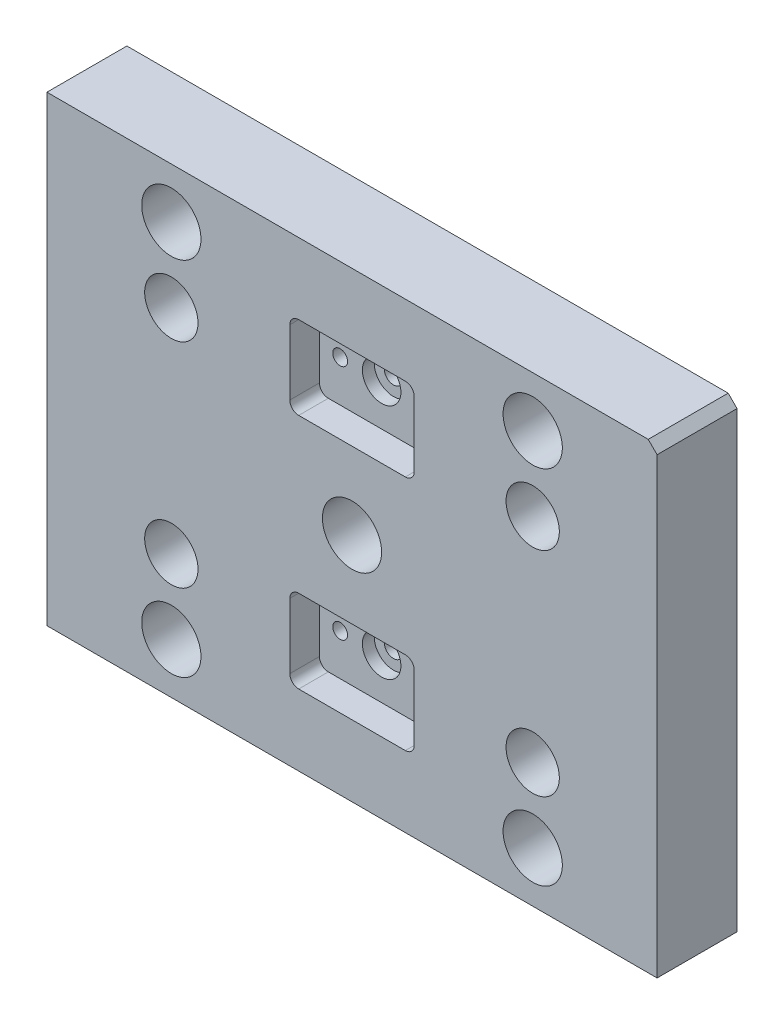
ISO-10303-21;
HEADER;
FILE_DESCRIPTION(('STEP AP214'),'2;1');
FILE_NAME('part.step','',(''),(''),'','','');
FILE_SCHEMA(('AUTOMOTIVE_DESIGN { 1 0 10303 214 1 1 1 1 }'));
ENDSEC;
DATA;
#1=APPLICATION_CONTEXT('core data for automotive mechanical design processes');
#2=APPLICATION_PROTOCOL_DEFINITION('international standard','automotive_design',2000,#1);
#3=PRODUCT_CONTEXT('',#1,'mechanical');
#4=PRODUCT('Part','Part','',(#3));
#5=PRODUCT_RELATED_PRODUCT_CATEGORY('part','',(#4));
#6=PRODUCT_DEFINITION_FORMATION('','',#4);
#7=PRODUCT_DEFINITION_CONTEXT('part definition',#1,'design');
#8=PRODUCT_DEFINITION('design','',#6,#7);
#9=PRODUCT_DEFINITION_SHAPE('','',#8);
#10=(LENGTH_UNIT() NAMED_UNIT(*) SI_UNIT(.MILLI.,.METRE.));
#11=(NAMED_UNIT(*) PLANE_ANGLE_UNIT() SI_UNIT($,.RADIAN.));
#12=(NAMED_UNIT(*) SI_UNIT($,.STERADIAN.) SOLID_ANGLE_UNIT());
#13=UNCERTAINTY_MEASURE_WITH_UNIT(LENGTH_MEASURE(1.E-05),#10,'distance_accuracy_value','');
#14=(GEOMETRIC_REPRESENTATION_CONTEXT(3) GLOBAL_UNCERTAINTY_ASSIGNED_CONTEXT((#13)) GLOBAL_UNIT_ASSIGNED_CONTEXT((#10,
#11,#12)) REPRESENTATION_CONTEXT('',''));
#15=CARTESIAN_POINT('',(0.,0.,0.));
#16=DIRECTION('',(0.,0.,1.));
#17=DIRECTION('',(1.,0.,0.));
#18=AXIS2_PLACEMENT_3D('',#15,#16,#17);
#19=CARTESIAN_POINT('',(0.,-40.,27.));
#20=DIRECTION('',(0.,0.,-1.));
#21=DIRECTION('',(-1.,0.,0.));
#22=AXIS2_PLACEMENT_3D('',#19,#20,#21);
#23=CYLINDRICAL_SURFACE('',#22,3.1);
#24=CARTESIAN_POINT('',(0.,-40.,0.));
#25=DIRECTION('',(0.,0.,-1.));
#26=DIRECTION('',(-1.,0.,0.));
#27=AXIS2_PLACEMENT_3D('',#24,#25,#26);
#28=CIRCLE('',#27,3.1);
#29=CARTESIAN_POINT('',(-3.1,-40.,0.));
#30=VERTEX_POINT('',#29);
#31=EDGE_CURVE('E318',#30,#30,#28,.T.);
#32=ORIENTED_EDGE('',*,*,#31,.T.);
#33=EDGE_LOOP('',(#32));
#34=FACE_BOUND('',#33,.T.);
#35=CARTESIAN_POINT('',(0.,-40.,13.));
#36=DIRECTION('',(0.,0.,1.));
#37=DIRECTION('',(1.,0.,0.));
#38=AXIS2_PLACEMENT_3D('',#35,#36,#37);
#39=CIRCLE('',#38,3.1);
#40=CARTESIAN_POINT('',(3.09999999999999,-40.,13.));
#41=VERTEX_POINT('',#40);
#42=EDGE_CURVE('E43',#41,#41,#39,.F.);
#43=ORIENTED_EDGE('',*,*,#42,.F.);
#44=EDGE_LOOP('',(#43));
#45=FACE_BOUND('',#44,.T.);
#46=ADVANCED_FACE('F39',(#34,#45),#23,.F.);
#47=CARTESIAN_POINT('',(0.,40.,27.));
#48=DIRECTION('',(0.,0.,-1.));
#49=DIRECTION('',(-1.,0.,0.));
#50=AXIS2_PLACEMENT_3D('',#47,#48,#49);
#51=CYLINDRICAL_SURFACE('',#50,3.1);
#52=CARTESIAN_POINT('',(0.,40.,0.));
#53=DIRECTION('',(0.,0.,-1.));
#54=DIRECTION('',(-1.,0.,0.));
#55=AXIS2_PLACEMENT_3D('',#52,#53,#54);
#56=CIRCLE('',#55,3.1);
#57=CARTESIAN_POINT('',(-3.1,40.,0.));
#58=VERTEX_POINT('',#57);
#59=EDGE_CURVE('E313',#58,#58,#56,.T.);
#60=ORIENTED_EDGE('',*,*,#59,.T.);
#61=EDGE_LOOP('',(#60));
#62=FACE_BOUND('',#61,.T.);
#63=CARTESIAN_POINT('',(0.,40.,13.));
#64=DIRECTION('',(0.,0.,1.));
#65=DIRECTION('',(1.,0.,0.));
#66=AXIS2_PLACEMENT_3D('',#63,#64,#65);
#67=CIRCLE('',#66,3.1);
#68=CARTESIAN_POINT('',(3.1,40.,13.));
#69=VERTEX_POINT('',#68);
#70=EDGE_CURVE('E311',#69,#69,#67,.F.);
#71=ORIENTED_EDGE('',*,*,#70,.F.);
#72=EDGE_LOOP('',(#71));
#73=FACE_BOUND('',#72,.T.);
#74=ADVANCED_FACE('F472',(#62,#73),#51,.F.);
#75=CARTESIAN_POINT('',(-103.,-78.,27.));
#76=DIRECTION('',(0.,0.,1.));
#77=DIRECTION('',(1.,0.,0.));
#78=AXIS2_PLACEMENT_3D('',#75,#76,#77);
#79=PLANE('',#78);
#80=CARTESIAN_POINT('',(-61.,-36.,27.));
#81=DIRECTION('',(0.,0.,-1.));
#82=DIRECTION('',(1.,0.,0.));
#83=AXIS2_PLACEMENT_3D('',#80,#81,#82);
#84=CIRCLE('',#83,9.);
#85=CARTESIAN_POINT('',(-52.,-36.,27.));
#86=VERTEX_POINT('',#85);
#87=EDGE_CURVE('E375',#86,#86,#84,.T.);
#88=ORIENTED_EDGE('',*,*,#87,.T.);
#89=EDGE_LOOP('',(#88));
#90=FACE_BOUND('',#89,.T.);
#91=CARTESIAN_POINT('',(-61.,-61.,27.));
#92=DIRECTION('',(0.,0.,-1.));
#93=DIRECTION('',(1.,0.,0.));
#94=AXIS2_PLACEMENT_3D('',#91,#92,#93);
#95=CIRCLE('',#94,10.);
#96=CARTESIAN_POINT('',(-51.,-61.,27.));
#97=VERTEX_POINT('',#96);
#98=EDGE_CURVE('E392',#97,#97,#95,.T.);
#99=ORIENTED_EDGE('',*,*,#98,.T.);
#100=EDGE_LOOP('',(#99));
#101=FACE_BOUND('',#100,.T.);
#102=CARTESIAN_POINT('',(61.,-36.,27.));
#103=DIRECTION('',(0.,0.,1.));
#104=DIRECTION('',(-1.,0.,0.));
#105=AXIS2_PLACEMENT_3D('',#102,#103,#104);
#106=CIRCLE('',#105,9.);
#107=CARTESIAN_POINT('',(70.,-36.,27.));
#108=VERTEX_POINT('',#107);
#109=EDGE_CURVE('E396',#108,#108,#106,.T.);
#110=ORIENTED_EDGE('',*,*,#109,.F.);
#111=EDGE_LOOP('',(#110));
#112=FACE_BOUND('',#111,.T.);
#113=CARTESIAN_POINT('',(61.,-61.,27.));
#114=DIRECTION('',(0.,0.,1.));
#115=DIRECTION('',(-1.,0.,0.));
#116=AXIS2_PLACEMENT_3D('',#113,#114,#115);
#117=CIRCLE('',#116,10.);
#118=CARTESIAN_POINT('',(51.,-61.,27.));
#119=VERTEX_POINT('',#118);
#120=EDGE_CURVE('E405',#119,#119,#117,.T.);
#121=ORIENTED_EDGE('',*,*,#120,.F.);
#122=EDGE_LOOP('',(#121));
#123=FACE_BOUND('',#122,.T.);
#124=DIRECTION('',(0.,1.,0.));
#125=VECTOR('',#124,1.);
#126=CARTESIAN_POINT('',(103.,78.,27.));
#127=LINE('',#126,#125);
#128=CARTESIAN_POINT('',(103.,-78.,27.));
#129=VERTEX_POINT('',#128);
#130=CARTESIAN_POINT('',(103.,75.,27.));
#131=VERTEX_POINT('',#130);
#132=EDGE_CURVE('E194',#129,#131,#127,.T.);
#133=ORIENTED_EDGE('',*,*,#132,.T.);
#134=DIRECTION('',(0.707106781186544,-0.707106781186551,0.));
#135=VECTOR('',#134,1.);
#136=CARTESIAN_POINT('',(76.5000000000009,101.499999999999,27.));
#137=LINE('',#136,#135);
#138=CARTESIAN_POINT('',(100.,78.,27.));
#139=VERTEX_POINT('',#138);
#140=EDGE_CURVE('E278',#131,#139,#137,.F.);
#141=ORIENTED_EDGE('',*,*,#140,.T.);
#142=DIRECTION('',(-1.,0.,0.));
#143=VECTOR('',#142,1.);
#144=CARTESIAN_POINT('',(-103.,78.,27.));
#145=LINE('',#144,#143);
#146=CARTESIAN_POINT('',(-103.,78.,27.));
#147=VERTEX_POINT('',#146);
#148=EDGE_CURVE('E201',#139,#147,#145,.T.);
#149=ORIENTED_EDGE('',*,*,#148,.T.);
#150=DIRECTION('',(0.,-1.,0.));
#151=VECTOR('',#150,1.);
#152=CARTESIAN_POINT('',(-103.,78.,27.));
#153=LINE('',#152,#151);
#154=CARTESIAN_POINT('',(-103.,-78.,27.));
#155=VERTEX_POINT('',#154);
#156=EDGE_CURVE('E195',#147,#155,#153,.T.);
#157=ORIENTED_EDGE('',*,*,#156,.T.);
#158=DIRECTION('',(1.,0.,0.));
#159=VECTOR('',#158,1.);
#160=CARTESIAN_POINT('',(-103.,-78.,27.));
#161=LINE('',#160,#159);
#162=EDGE_CURVE('E183',#155,#129,#161,.T.);
#163=ORIENTED_EDGE('',*,*,#162,.T.);
#164=EDGE_LOOP('',(#133,#141,#149,#157,#163));
#165=FACE_BOUND('',#164,.T.);
#166=CARTESIAN_POINT('',(-61.,61.,27.));
#167=DIRECTION('',(0.,0.,1.));
#168=DIRECTION('',(1.,0.,0.));
#169=AXIS2_PLACEMENT_3D('',#166,#167,#168);
#170=CIRCLE('',#169,10.);
#171=CARTESIAN_POINT('',(-51.,61.,27.));
#172=VERTEX_POINT('',#171);
#173=EDGE_CURVE('E431',#172,#172,#170,.T.);
#174=ORIENTED_EDGE('',*,*,#173,.F.);
#175=EDGE_LOOP('',(#174));
#176=FACE_BOUND('',#175,.T.);
#177=CARTESIAN_POINT('',(-61.,36.,27.));
#178=DIRECTION('',(0.,0.,1.));
#179=DIRECTION('',(1.,0.,0.));
#180=AXIS2_PLACEMENT_3D('',#177,#178,#179);
#181=CIRCLE('',#180,9.);
#182=CARTESIAN_POINT('',(-52.,36.,27.));
#183=VERTEX_POINT('',#182);
#184=EDGE_CURVE('E422',#183,#183,#181,.T.);
#185=ORIENTED_EDGE('',*,*,#184,.F.);
#186=EDGE_LOOP('',(#185));
#187=FACE_BOUND('',#186,.T.);
#188=CARTESIAN_POINT('',(61.,61.,27.));
#189=DIRECTION('',(0.,0.,-1.));
#190=DIRECTION('',(-1.,0.,0.));
#191=AXIS2_PLACEMENT_3D('',#188,#189,#190);
#192=CIRCLE('',#191,10.);
#193=CARTESIAN_POINT('',(51.,61.,27.));
#194=VERTEX_POINT('',#193);
#195=EDGE_CURVE('E418',#194,#194,#192,.T.);
#196=ORIENTED_EDGE('',*,*,#195,.T.);
#197=EDGE_LOOP('',(#196));
#198=FACE_BOUND('',#197,.T.);
#199=CARTESIAN_POINT('',(61.,36.,27.));
#200=DIRECTION('',(0.,0.,-1.));
#201=DIRECTION('',(-1.,0.,0.));
#202=AXIS2_PLACEMENT_3D('',#199,#200,#201);
#203=CIRCLE('',#202,9.);
#204=CARTESIAN_POINT('',(70.,36.,27.));
#205=VERTEX_POINT('',#204);
#206=EDGE_CURVE('E409',#205,#205,#203,.T.);
#207=ORIENTED_EDGE('',*,*,#206,.T.);
#208=EDGE_LOOP('',(#207));
#209=FACE_BOUND('',#208,.T.);
#210=DIRECTION('',(0.,-1.,0.));
#211=VECTOR('',#210,1.);
#212=CARTESIAN_POINT('',(-21.,-26.,27.));
#213=LINE('',#212,#211);
#214=CARTESIAN_POINT('',(-21.,-29.,27.));
#215=VERTEX_POINT('',#214);
#216=CARTESIAN_POINT('',(-21.,-51.,27.));
#217=VERTEX_POINT('',#216);
#218=EDGE_CURVE('E359',#215,#217,#213,.T.);
#219=ORIENTED_EDGE('',*,*,#218,.F.);
#220=CARTESIAN_POINT('',(-18.,-29.,27.));
#221=DIRECTION('',(0.,0.,1.));
#222=DIRECTION('',(1.,0.,0.));
#223=AXIS2_PLACEMENT_3D('',#220,#221,#222);
#224=CIRCLE('',#223,3.);
#225=CARTESIAN_POINT('',(-18.,-26.,27.));
#226=VERTEX_POINT('',#225);
#227=EDGE_CURVE('E269',#215,#226,#224,.F.);
#228=ORIENTED_EDGE('',*,*,#227,.T.);
#229=DIRECTION('',(-1.,0.,0.));
#230=VECTOR('',#229,1.);
#231=CARTESIAN_POINT('',(-21.,-26.,27.));
#232=LINE('',#231,#230);
#233=CARTESIAN_POINT('',(18.,-26.,27.));
#234=VERTEX_POINT('',#233);
#235=EDGE_CURVE('E366',#234,#226,#232,.T.);
#236=ORIENTED_EDGE('',*,*,#235,.F.);
#237=CARTESIAN_POINT('',(18.,-29.,27.));
#238=DIRECTION('',(0.,0.,1.));
#239=DIRECTION('',(1.,0.,0.));
#240=AXIS2_PLACEMENT_3D('',#237,#238,#239);
#241=CIRCLE('',#240,3.);
#242=CARTESIAN_POINT('',(21.,-29.,27.));
#243=VERTEX_POINT('',#242);
#244=EDGE_CURVE('E267',#234,#243,#241,.F.);
#245=ORIENTED_EDGE('',*,*,#244,.T.);
#246=DIRECTION('',(0.,1.,0.));
#247=VECTOR('',#246,1.);
#248=CARTESIAN_POINT('',(21.,-26.,27.));
#249=LINE('',#248,#247);
#250=CARTESIAN_POINT('',(21.,-51.,27.));
#251=VERTEX_POINT('',#250);
#252=EDGE_CURVE('E381',#251,#243,#249,.T.);
#253=ORIENTED_EDGE('',*,*,#252,.F.);
#254=CARTESIAN_POINT('',(18.,-51.,27.));
#255=DIRECTION('',(0.,0.,1.));
#256=DIRECTION('',(1.,0.,0.));
#257=AXIS2_PLACEMENT_3D('',#254,#255,#256);
#258=CIRCLE('',#257,3.);
#259=CARTESIAN_POINT('',(18.,-54.,27.));
#260=VERTEX_POINT('',#259);
#261=EDGE_CURVE('E265',#251,#260,#258,.F.);
#262=ORIENTED_EDGE('',*,*,#261,.T.);
#263=DIRECTION('',(1.,0.,0.));
#264=VECTOR('',#263,1.);
#265=CARTESIAN_POINT('',(-21.,-54.,27.));
#266=LINE('',#265,#264);
#267=CARTESIAN_POINT('',(-18.,-54.,27.));
#268=VERTEX_POINT('',#267);
#269=EDGE_CURVE('E378',#268,#260,#266,.T.);
#270=ORIENTED_EDGE('',*,*,#269,.F.);
#271=CARTESIAN_POINT('',(-18.,-51.,27.));
#272=DIRECTION('',(0.,0.,1.));
#273=DIRECTION('',(1.,0.,0.));
#274=AXIS2_PLACEMENT_3D('',#271,#272,#273);
#275=CIRCLE('',#274,3.);
#276=EDGE_CURVE('E263',#268,#217,#275,.F.);
#277=ORIENTED_EDGE('',*,*,#276,.T.);
#278=EDGE_LOOP('',(#219,#228,#236,#245,#253,#262,#270,#277));
#279=FACE_BOUND('',#278,.T.);
#280=CARTESIAN_POINT('',(0.,0.,27.));
#281=DIRECTION('',(0.,0.,1.));
#282=DIRECTION('',(1.,0.,0.));
#283=AXIS2_PLACEMENT_3D('',#280,#281,#282);
#284=CIRCLE('',#283,10.);
#285=CARTESIAN_POINT('',(10.,0.,27.));
#286=VERTEX_POINT('',#285);
#287=EDGE_CURVE('E347',#286,#286,#284,.T.);
#288=ORIENTED_EDGE('',*,*,#287,.F.);
#289=EDGE_LOOP('',(#288));
#290=FACE_BOUND('',#289,.T.);
#291=DIRECTION('',(0.,-1.,0.));
#292=VECTOR('',#291,1.);
#293=CARTESIAN_POINT('',(21.,26.,27.));
#294=LINE('',#293,#292);
#295=CARTESIAN_POINT('',(21.,51.,27.));
#296=VERTEX_POINT('',#295);
#297=CARTESIAN_POINT('',(21.,29.,27.));
#298=VERTEX_POINT('',#297);
#299=EDGE_CURVE('E352',#296,#298,#294,.T.);
#300=ORIENTED_EDGE('',*,*,#299,.T.);
#301=CARTESIAN_POINT('',(18.,29.,27.));
#302=DIRECTION('',(0.,0.,1.));
#303=DIRECTION('',(1.,0.,0.));
#304=AXIS2_PLACEMENT_3D('',#301,#302,#303);
#305=CIRCLE('',#304,3.);
#306=CARTESIAN_POINT('',(18.,26.,27.));
#307=VERTEX_POINT('',#306);
#308=EDGE_CURVE('E48',#298,#307,#305,.F.);
#309=ORIENTED_EDGE('',*,*,#308,.T.);
#310=DIRECTION('',(-1.,0.,0.));
#311=VECTOR('',#310,1.);
#312=CARTESIAN_POINT('',(-21.,26.,27.));
#313=LINE('',#312,#311);
#314=CARTESIAN_POINT('',(-18.,26.,27.));
#315=VERTEX_POINT('',#314);
#316=EDGE_CURVE('E350',#307,#315,#313,.T.);
#317=ORIENTED_EDGE('',*,*,#316,.T.);
#318=CARTESIAN_POINT('',(-18.,29.,27.));
#319=DIRECTION('',(0.,0.,1.));
#320=DIRECTION('',(1.,0.,0.));
#321=AXIS2_PLACEMENT_3D('',#318,#319,#320);
#322=CIRCLE('',#321,3.);
#323=CARTESIAN_POINT('',(-21.,29.,27.));
#324=VERTEX_POINT('',#323);
#325=EDGE_CURVE('E11',#315,#324,#322,.F.);
#326=ORIENTED_EDGE('',*,*,#325,.T.);
#327=DIRECTION('',(0.,1.,0.));
#328=VECTOR('',#327,1.);
#329=CARTESIAN_POINT('',(-21.,26.,27.));
#330=LINE('',#329,#328);
#331=CARTESIAN_POINT('',(-21.,51.,27.));
#332=VERTEX_POINT('',#331);
#333=EDGE_CURVE('E333',#324,#332,#330,.T.);
#334=ORIENTED_EDGE('',*,*,#333,.T.);
#335=CARTESIAN_POINT('',(-18.,51.,27.));
#336=DIRECTION('',(0.,0.,1.));
#337=DIRECTION('',(1.,0.,0.));
#338=AXIS2_PLACEMENT_3D('',#335,#336,#337);
#339=CIRCLE('',#338,3.);
#340=CARTESIAN_POINT('',(-18.,54.,27.));
#341=VERTEX_POINT('',#340);
#342=EDGE_CURVE('E307',#332,#341,#339,.F.);
#343=ORIENTED_EDGE('',*,*,#342,.T.);
#344=DIRECTION('',(1.,0.,0.));
#345=VECTOR('',#344,1.);
#346=CARTESIAN_POINT('',(-21.,54.,27.));
#347=LINE('',#346,#345);
#348=CARTESIAN_POINT('',(18.,54.,27.));
#349=VERTEX_POINT('',#348);
#350=EDGE_CURVE('E338',#341,#349,#347,.T.);
#351=ORIENTED_EDGE('',*,*,#350,.T.);
#352=CARTESIAN_POINT('',(18.,51.,27.));
#353=DIRECTION('',(0.,0.,1.));
#354=DIRECTION('',(1.,0.,0.));
#355=AXIS2_PLACEMENT_3D('',#352,#353,#354);
#356=CIRCLE('',#355,3.);
#357=EDGE_CURVE('E309',#349,#296,#356,.F.);
#358=ORIENTED_EDGE('',*,*,#357,.T.);
#359=EDGE_LOOP('',(#300,#309,#317,#326,#334,#343,#351,#358));
#360=FACE_BOUND('',#359,.T.);
#361=ADVANCED_FACE('F198',(#90,#101,#112,#123,#165,#176,#187,#198,#209,#279,#290,#360),#79,.T.);
#362=CARTESIAN_POINT('',(-61.,-36.,0.));
#363=DIRECTION('',(0.,0.,1.));
#364=DIRECTION('',(1.,0.,0.));
#365=AXIS2_PLACEMENT_3D('',#362,#363,#364);
#366=CYLINDRICAL_SURFACE('',#365,5.25);
#367=CARTESIAN_POINT('',(-61.,-36.,0.));
#368=DIRECTION('',(0.,0.,-1.));
#369=DIRECTION('',(1.,0.,0.));
#370=AXIS2_PLACEMENT_3D('',#367,#368,#369);
#371=CIRCLE('',#370,5.25);
#372=CARTESIAN_POINT('',(-55.75,-36.,0.));
#373=VERTEX_POINT('',#372);
#374=EDGE_CURVE('E235',#373,#373,#371,.T.);
#375=ORIENTED_EDGE('',*,*,#374,.T.);
#376=EDGE_LOOP('',(#375));
#377=FACE_BOUND('',#376,.T.);
#378=CARTESIAN_POINT('',(-61.,-36.,14.));
#379=DIRECTION('',(0.,0.,1.));
#380=DIRECTION('',(1.,0.,0.));
#381=AXIS2_PLACEMENT_3D('',#378,#379,#380);
#382=CIRCLE('',#381,5.25);
#383=CARTESIAN_POINT('',(-55.75,-36.,14.));
#384=VERTEX_POINT('',#383);
#385=EDGE_CURVE('E233',#384,#384,#382,.T.);
#386=ORIENTED_EDGE('',*,*,#385,.T.);
#387=EDGE_LOOP('',(#386));
#388=FACE_BOUND('',#387,.T.);
#389=ADVANCED_FACE('F539',(#377,#388),#366,.F.);
#390=CARTESIAN_POINT('',(-103.,-78.,0.));
#391=DIRECTION('',(0.,0.,1.));
#392=DIRECTION('',(1.,0.,0.));
#393=AXIS2_PLACEMENT_3D('',#390,#391,#392);
#394=PLANE('',#393);
#395=CARTESIAN_POINT('',(14.,-40.,0.));
#396=DIRECTION('',(0.,0.,1.));
#397=DIRECTION('',(1.,0.,0.));
#398=AXIS2_PLACEMENT_3D('',#395,#396,#397);
#399=CIRCLE('',#398,2.5);
#400=CARTESIAN_POINT('',(16.5,-40.,0.));
#401=VERTEX_POINT('',#400);
#402=EDGE_CURVE('E598',#401,#401,#399,.T.);
#403=ORIENTED_EDGE('',*,*,#402,.T.);
#404=EDGE_LOOP('',(#403));
#405=FACE_BOUND('',#404,.T.);
#406=CARTESIAN_POINT('',(-14.,-40.,0.));
#407=DIRECTION('',(0.,0.,1.));
#408=DIRECTION('',(1.,0.,0.));
#409=AXIS2_PLACEMENT_3D('',#406,#407,#408);
#410=CIRCLE('',#409,2.5);
#411=CARTESIAN_POINT('',(-11.5,-40.,0.));
#412=VERTEX_POINT('',#411);
#413=EDGE_CURVE('E602',#412,#412,#410,.T.);
#414=ORIENTED_EDGE('',*,*,#413,.T.);
#415=EDGE_LOOP('',(#414));
#416=FACE_BOUND('',#415,.T.);
#417=CARTESIAN_POINT('',(14.,40.,0.));
#418=DIRECTION('',(0.,0.,1.));
#419=DIRECTION('',(1.,0.,0.));
#420=AXIS2_PLACEMENT_3D('',#417,#418,#419);
#421=CIRCLE('',#420,2.5);
#422=CARTESIAN_POINT('',(16.5,40.,0.));
#423=VERTEX_POINT('',#422);
#424=EDGE_CURVE('E606',#423,#423,#421,.T.);
#425=ORIENTED_EDGE('',*,*,#424,.T.);
#426=EDGE_LOOP('',(#425));
#427=FACE_BOUND('',#426,.T.);
#428=CARTESIAN_POINT('',(-14.,40.,0.));
#429=DIRECTION('',(0.,0.,1.));
#430=DIRECTION('',(1.,0.,0.));
#431=AXIS2_PLACEMENT_3D('',#428,#429,#430);
#432=CIRCLE('',#431,2.5);
#433=CARTESIAN_POINT('',(-11.5,40.,0.));
#434=VERTEX_POINT('',#433);
#435=EDGE_CURVE('E610',#434,#434,#432,.T.);
#436=ORIENTED_EDGE('',*,*,#435,.T.);
#437=EDGE_LOOP('',(#436));
#438=FACE_BOUND('',#437,.T.);
#439=ORIENTED_EDGE('',*,*,#59,.F.);
#440=EDGE_LOOP('',(#439));
#441=FACE_BOUND('',#440,.T.);
#442=ORIENTED_EDGE('',*,*,#31,.F.);
#443=EDGE_LOOP('',(#442));
#444=FACE_BOUND('',#443,.T.);
#445=CARTESIAN_POINT('',(0.,0.,0.));
#446=DIRECTION('',(0.,0.,1.));
#447=DIRECTION('',(1.,0.,0.));
#448=AXIS2_PLACEMENT_3D('',#445,#446,#447);
#449=CIRCLE('',#448,10.);
#450=CARTESIAN_POINT('',(10.,0.,0.));
#451=VERTEX_POINT('',#450);
#452=EDGE_CURVE('E356',#451,#451,#449,.T.);
#453=ORIENTED_EDGE('',*,*,#452,.T.);
#454=EDGE_LOOP('',(#453));
#455=FACE_BOUND('',#454,.T.);
#456=CARTESIAN_POINT('',(-61.,-61.,0.));
#457=DIRECTION('',(0.,0.,-1.));
#458=DIRECTION('',(1.,0.,0.));
#459=AXIS2_PLACEMENT_3D('',#456,#457,#458);
#460=CIRCLE('',#459,10.);
#461=CARTESIAN_POINT('',(-51.,-61.,0.));
#462=VERTEX_POINT('',#461);
#463=EDGE_CURVE('E393',#462,#462,#460,.T.);
#464=ORIENTED_EDGE('',*,*,#463,.F.);
#465=EDGE_LOOP('',(#464));
#466=FACE_BOUND('',#465,.T.);
#467=CARTESIAN_POINT('',(61.,-36.,0.));
#468=DIRECTION('',(0.,0.,1.));
#469=DIRECTION('',(-1.,0.,0.));
#470=AXIS2_PLACEMENT_3D('',#467,#468,#469);
#471=CIRCLE('',#470,5.25);
#472=CARTESIAN_POINT('',(55.75,-36.,0.));
#473=VERTEX_POINT('',#472);
#474=EDGE_CURVE('E231',#473,#473,#471,.T.);
#475=ORIENTED_EDGE('',*,*,#474,.T.);
#476=EDGE_LOOP('',(#475));
#477=FACE_BOUND('',#476,.T.);
#478=CARTESIAN_POINT('',(61.,-61.,0.));
#479=DIRECTION('',(0.,0.,1.));
#480=DIRECTION('',(-1.,0.,0.));
#481=AXIS2_PLACEMENT_3D('',#478,#479,#480);
#482=CIRCLE('',#481,10.);
#483=CARTESIAN_POINT('',(51.,-61.,0.));
#484=VERTEX_POINT('',#483);
#485=EDGE_CURVE('E406',#484,#484,#482,.T.);
#486=ORIENTED_EDGE('',*,*,#485,.T.);
#487=EDGE_LOOP('',(#486));
#488=FACE_BOUND('',#487,.T.);
#489=CARTESIAN_POINT('',(61.,61.,0.));
#490=DIRECTION('',(0.,0.,-1.));
#491=DIRECTION('',(-1.,0.,0.));
#492=AXIS2_PLACEMENT_3D('',#489,#490,#491);
#493=CIRCLE('',#492,10.);
#494=CARTESIAN_POINT('',(51.,61.,0.));
#495=VERTEX_POINT('',#494);
#496=EDGE_CURVE('E419',#495,#495,#493,.T.);
#497=ORIENTED_EDGE('',*,*,#496,.F.);
#498=EDGE_LOOP('',(#497));
#499=FACE_BOUND('',#498,.T.);
#500=CARTESIAN_POINT('',(-61.,36.,0.));
#501=DIRECTION('',(0.,0.,1.));
#502=DIRECTION('',(1.,0.,0.));
#503=AXIS2_PLACEMENT_3D('',#500,#501,#502);
#504=CIRCLE('',#503,5.25);
#505=CARTESIAN_POINT('',(-55.75,36.,0.));
#506=VERTEX_POINT('',#505);
#507=EDGE_CURVE('E221',#506,#506,#504,.T.);
#508=ORIENTED_EDGE('',*,*,#507,.T.);
#509=EDGE_LOOP('',(#508));
#510=FACE_BOUND('',#509,.T.);
#511=CARTESIAN_POINT('',(-61.,61.,0.));
#512=DIRECTION('',(0.,0.,1.));
#513=DIRECTION('',(1.,0.,0.));
#514=AXIS2_PLACEMENT_3D('',#511,#512,#513);
#515=CIRCLE('',#514,10.);
#516=CARTESIAN_POINT('',(-51.,61.,0.));
#517=VERTEX_POINT('',#516);
#518=EDGE_CURVE('E432',#517,#517,#515,.T.);
#519=ORIENTED_EDGE('',*,*,#518,.T.);
#520=EDGE_LOOP('',(#519));
#521=FACE_BOUND('',#520,.T.);
#522=DIRECTION('',(-1.,0.,0.));
#523=VECTOR('',#522,1.);
#524=CARTESIAN_POINT('',(-103.,78.,0.));
#525=LINE('',#524,#523);
#526=CARTESIAN_POINT('',(100.,78.,0.));
#527=VERTEX_POINT('',#526);
#528=CARTESIAN_POINT('',(-103.,78.,0.));
#529=VERTEX_POINT('',#528);
#530=EDGE_CURVE('E205',#527,#529,#525,.T.);
#531=ORIENTED_EDGE('',*,*,#530,.F.);
#532=DIRECTION('',(-0.707106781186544,0.707106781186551,0.));
#533=VECTOR('',#532,1.);
#534=CARTESIAN_POINT('',(100.,78.,0.));
#535=LINE('',#534,#533);
#536=CARTESIAN_POINT('',(103.,75.,0.));
#537=VERTEX_POINT('',#536);
#538=EDGE_CURVE('E274',#527,#537,#535,.F.);
#539=ORIENTED_EDGE('',*,*,#538,.T.);
#540=DIRECTION('',(0.,1.,0.));
#541=VECTOR('',#540,1.);
#542=CARTESIAN_POINT('',(103.,78.,0.));
#543=LINE('',#542,#541);
#544=CARTESIAN_POINT('',(103.,-78.,0.));
#545=VERTEX_POINT('',#544);
#546=EDGE_CURVE('E442',#545,#537,#543,.T.);
#547=ORIENTED_EDGE('',*,*,#546,.F.);
#548=DIRECTION('',(1.,0.,0.));
#549=VECTOR('',#548,1.);
#550=CARTESIAN_POINT('',(-103.,-78.,0.));
#551=LINE('',#550,#549);
#552=CARTESIAN_POINT('',(-103.,-78.,0.));
#553=VERTEX_POINT('',#552);
#554=EDGE_CURVE('E440',#553,#545,#551,.T.);
#555=ORIENTED_EDGE('',*,*,#554,.F.);
#556=DIRECTION('',(0.,-1.,0.));
#557=VECTOR('',#556,1.);
#558=CARTESIAN_POINT('',(-103.,78.,0.));
#559=LINE('',#558,#557);
#560=EDGE_CURVE('E209',#529,#553,#559,.T.);
#561=ORIENTED_EDGE('',*,*,#560,.F.);
#562=EDGE_LOOP('',(#531,#539,#547,#555,#561));
#563=FACE_BOUND('',#562,.T.);
#564=CARTESIAN_POINT('',(61.,36.,0.));
#565=DIRECTION('',(0.,0.,-1.));
#566=DIRECTION('',(-1.,0.,0.));
#567=AXIS2_PLACEMENT_3D('',#564,#565,#566);
#568=CIRCLE('',#567,5.25);
#569=CARTESIAN_POINT('',(55.75,36.,0.));
#570=VERTEX_POINT('',#569);
#571=EDGE_CURVE('E226',#570,#570,#568,.T.);
#572=ORIENTED_EDGE('',*,*,#571,.F.);
#573=EDGE_LOOP('',(#572));
#574=FACE_BOUND('',#573,.T.);
#575=ORIENTED_EDGE('',*,*,#374,.F.);
#576=EDGE_LOOP('',(#575));
#577=FACE_BOUND('',#576,.T.);
#578=ADVANCED_FACE('F448',(#405,#416,#427,#438,#441,#444,#455,#466,#477,#488,#499,#510,#521,
#563,#574,#577),#394,.F.);
#579=CARTESIAN_POINT('',(61.,-36.,0.));
#580=DIRECTION('',(0.,0.,1.));
#581=DIRECTION('',(1.,0.,0.));
#582=AXIS2_PLACEMENT_3D('',#579,#580,#581);
#583=CYLINDRICAL_SURFACE('',#582,5.25);
#584=ORIENTED_EDGE('',*,*,#474,.F.);
#585=EDGE_LOOP('',(#584));
#586=FACE_BOUND('',#585,.T.);
#587=CARTESIAN_POINT('',(61.,-36.,14.));
#588=DIRECTION('',(0.,0.,1.));
#589=DIRECTION('',(1.,0.,0.));
#590=AXIS2_PLACEMENT_3D('',#587,#588,#589);
#591=CIRCLE('',#590,5.25);
#592=CARTESIAN_POINT('',(66.25,-36.,14.));
#593=VERTEX_POINT('',#592);
#594=EDGE_CURVE('E228',#593,#593,#591,.F.);
#595=ORIENTED_EDGE('',*,*,#594,.F.);
#596=EDGE_LOOP('',(#595));
#597=FACE_BOUND('',#596,.T.);
#598=ADVANCED_FACE('F555',(#586,#597),#583,.F.);
#599=CARTESIAN_POINT('',(61.,36.,0.));
#600=DIRECTION('',(0.,0.,1.));
#601=DIRECTION('',(1.,0.,0.));
#602=AXIS2_PLACEMENT_3D('',#599,#600,#601);
#603=CYLINDRICAL_SURFACE('',#602,5.25);
#604=ORIENTED_EDGE('',*,*,#571,.T.);
#605=EDGE_LOOP('',(#604));
#606=FACE_BOUND('',#605,.T.);
#607=CARTESIAN_POINT('',(61.,36.,14.));
#608=DIRECTION('',(0.,0.,1.));
#609=DIRECTION('',(1.,0.,0.));
#610=AXIS2_PLACEMENT_3D('',#607,#608,#609);
#611=CIRCLE('',#610,5.25);
#612=CARTESIAN_POINT('',(66.25,36.,14.));
#613=VERTEX_POINT('',#612);
#614=EDGE_CURVE('E223',#613,#613,#611,.T.);
#615=ORIENTED_EDGE('',*,*,#614,.T.);
#616=EDGE_LOOP('',(#615));
#617=FACE_BOUND('',#616,.T.);
#618=ADVANCED_FACE('F558',(#606,#617),#603,.F.);
#619=CARTESIAN_POINT('',(-61.,36.,0.));
#620=DIRECTION('',(0.,0.,1.));
#621=DIRECTION('',(1.,0.,0.));
#622=AXIS2_PLACEMENT_3D('',#619,#620,#621);
#623=CYLINDRICAL_SURFACE('',#622,5.25);
#624=ORIENTED_EDGE('',*,*,#507,.F.);
#625=EDGE_LOOP('',(#624));
#626=FACE_BOUND('',#625,.T.);
#627=CARTESIAN_POINT('',(-61.,36.,14.));
#628=DIRECTION('',(0.,0.,1.));
#629=DIRECTION('',(1.,0.,0.));
#630=AXIS2_PLACEMENT_3D('',#627,#628,#629);
#631=CIRCLE('',#630,5.25);
#632=CARTESIAN_POINT('',(-55.75,36.,14.));
#633=VERTEX_POINT('',#632);
#634=EDGE_CURVE('E218',#633,#633,#631,.F.);
#635=ORIENTED_EDGE('',*,*,#634,.F.);
#636=EDGE_LOOP('',(#635));
#637=FACE_BOUND('',#636,.T.);
#638=ADVANCED_FACE('F574',(#626,#637),#623,.F.);
#639=CARTESIAN_POINT('',(-103.,78.,27.));
#640=DIRECTION('',(1.,0.,0.));
#641=DIRECTION('',(0.,1.,0.));
#642=AXIS2_PLACEMENT_3D('',#639,#640,#641);
#643=PLANE('',#642);
#644=ORIENTED_EDGE('',*,*,#560,.T.);
#645=DIRECTION('',(0.,0.,-1.));
#646=VECTOR('',#645,1.);
#647=CARTESIAN_POINT('',(-103.,-78.,27.));
#648=LINE('',#647,#646);
#649=EDGE_CURVE('E187',#155,#553,#648,.T.);
#650=ORIENTED_EDGE('',*,*,#649,.F.);
#651=ORIENTED_EDGE('',*,*,#156,.F.);
#652=DIRECTION('',(0.,0.,-1.));
#653=VECTOR('',#652,1.);
#654=CARTESIAN_POINT('',(-103.,78.,27.));
#655=LINE('',#654,#653);
#656=EDGE_CURVE('E214',#147,#529,#655,.T.);
#657=ORIENTED_EDGE('',*,*,#656,.T.);
#658=EDGE_LOOP('',(#644,#650,#651,#657));
#659=FACE_BOUND('',#658,.T.);
#660=ADVANCED_FACE('F207',(#659),#643,.F.);
#661=CARTESIAN_POINT('',(-103.,-78.,27.));
#662=DIRECTION('',(0.,1.,0.));
#663=DIRECTION('',(0.,0.,1.));
#664=AXIS2_PLACEMENT_3D('',#661,#662,#663);
#665=PLANE('',#664);
#666=ORIENTED_EDGE('',*,*,#554,.T.);
#667=DIRECTION('',(0.,0.,-1.));
#668=VECTOR('',#667,1.);
#669=CARTESIAN_POINT('',(103.,-78.,27.));
#670=LINE('',#669,#668);
#671=EDGE_CURVE('E190',#129,#545,#670,.T.);
#672=ORIENTED_EDGE('',*,*,#671,.F.);
#673=ORIENTED_EDGE('',*,*,#162,.F.);
#674=ORIENTED_EDGE('',*,*,#649,.T.);
#675=EDGE_LOOP('',(#666,#672,#673,#674));
#676=FACE_BOUND('',#675,.T.);
#677=ADVANCED_FACE('F185',(#676),#665,.F.);
#678=CARTESIAN_POINT('',(103.,78.,27.));
#679=DIRECTION('',(-1.,0.,0.));
#680=DIRECTION('',(0.,-1.,0.));
#681=AXIS2_PLACEMENT_3D('',#678,#679,#680);
#682=PLANE('',#681);
#683=ORIENTED_EDGE('',*,*,#546,.T.);
#684=DIRECTION('',(0.,0.,1.));
#685=VECTOR('',#684,1.);
#686=CARTESIAN_POINT('',(103.,75.,27.));
#687=LINE('',#686,#685);
#688=EDGE_CURVE('E276',#537,#131,#687,.T.);
#689=ORIENTED_EDGE('',*,*,#688,.T.);
#690=ORIENTED_EDGE('',*,*,#132,.F.);
#691=ORIENTED_EDGE('',*,*,#671,.T.);
#692=EDGE_LOOP('',(#683,#689,#690,#691));
#693=FACE_BOUND('',#692,.T.);
#694=ADVANCED_FACE('F452',(#693),#682,.F.);
#695=CARTESIAN_POINT('',(-103.,78.,27.));
#696=DIRECTION('',(0.,-1.,0.));
#697=DIRECTION('',(0.,0.,-1.));
#698=AXIS2_PLACEMENT_3D('',#695,#696,#697);
#699=PLANE('',#698);
#700=ORIENTED_EDGE('',*,*,#148,.F.);
#701=DIRECTION('',(0.,0.,-1.));
#702=VECTOR('',#701,1.);
#703=CARTESIAN_POINT('',(100.,78.,27.));
#704=LINE('',#703,#702);
#705=EDGE_CURVE('E271',#139,#527,#704,.T.);
#706=ORIENTED_EDGE('',*,*,#705,.T.);
#707=ORIENTED_EDGE('',*,*,#530,.T.);
#708=ORIENTED_EDGE('',*,*,#656,.F.);
#709=EDGE_LOOP('',(#700,#706,#707,#708));
#710=FACE_BOUND('',#709,.T.);
#711=ADVANCED_FACE('F458',(#710),#699,.F.);
#712=CARTESIAN_POINT('',(-61.,61.,0.));
#713=DIRECTION('',(0.,0.,1.));
#714=DIRECTION('',(1.,0.,0.));
#715=AXIS2_PLACEMENT_3D('',#712,#713,#714);
#716=CYLINDRICAL_SURFACE('',#715,10.);
#717=ORIENTED_EDGE('',*,*,#518,.F.);
#718=EDGE_LOOP('',(#717));
#719=FACE_BOUND('',#718,.T.);
#720=ORIENTED_EDGE('',*,*,#173,.T.);
#721=EDGE_LOOP('',(#720));
#722=FACE_BOUND('',#721,.T.);
#723=ADVANCED_FACE('F460',(#719,#722),#716,.F.);
#724=CARTESIAN_POINT('',(-61.,36.,14.));
#725=DIRECTION('',(0.,0.,1.));
#726=DIRECTION('',(1.,0.,0.));
#727=AXIS2_PLACEMENT_3D('',#724,#725,#726);
#728=PLANE('',#727);
#729=CARTESIAN_POINT('',(-61.,36.,14.));
#730=DIRECTION('',(0.,0.,1.));
#731=DIRECTION('',(1.,0.,0.));
#732=AXIS2_PLACEMENT_3D('',#729,#730,#731);
#733=CIRCLE('',#732,9.);
#734=CARTESIAN_POINT('',(-52.,36.,14.));
#735=VERTEX_POINT('',#734);
#736=EDGE_CURVE('E222',#735,#735,#733,.T.);
#737=ORIENTED_EDGE('',*,*,#736,.T.);
#738=EDGE_LOOP('',(#737));
#739=FACE_BOUND('',#738,.T.);
#740=ORIENTED_EDGE('',*,*,#634,.T.);
#741=EDGE_LOOP('',(#740));
#742=FACE_BOUND('',#741,.T.);
#743=ADVANCED_FACE('F466',(#739,#742),#728,.T.);
#744=CARTESIAN_POINT('',(-61.,36.,14.));
#745=DIRECTION('',(0.,0.,1.));
#746=DIRECTION('',(1.,0.,0.));
#747=AXIS2_PLACEMENT_3D('',#744,#745,#746);
#748=CYLINDRICAL_SURFACE('',#747,9.);
#749=CARTESIAN_POINT('',(-52.,36.,14.));
#750=CARTESIAN_POINT('',(-52.,36.,14.1354166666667));
#751=CARTESIAN_POINT('',(-52.,36.,14.2708333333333));
#752=CARTESIAN_POINT('',(-52.,36.,14.5416666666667));
#753=CARTESIAN_POINT('',(-52.,36.,14.6770833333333));
#754=CARTESIAN_POINT('',(-52.,36.,14.9479166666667));
#755=CARTESIAN_POINT('',(-52.,36.,15.0833333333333));
#756=CARTESIAN_POINT('',(-52.,36.,15.3541666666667));
#757=CARTESIAN_POINT('',(-52.,36.,15.4895833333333));
#758=CARTESIAN_POINT('',(-52.,36.,15.7604166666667));
#759=CARTESIAN_POINT('',(-52.,36.,15.8958333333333));
#760=CARTESIAN_POINT('',(-52.,36.,16.1666666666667));
#761=CARTESIAN_POINT('',(-52.,36.,16.3020833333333));
#762=CARTESIAN_POINT('',(-52.,36.,16.5729166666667));
#763=CARTESIAN_POINT('',(-52.,36.,16.7083333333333));
#764=CARTESIAN_POINT('',(-52.,36.,16.9791666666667));
#765=CARTESIAN_POINT('',(-52.,36.,17.1145833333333));
#766=CARTESIAN_POINT('',(-52.,36.,17.3854166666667));
#767=CARTESIAN_POINT('',(-52.,36.,17.5208333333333));
#768=CARTESIAN_POINT('',(-52.,36.,17.7916666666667));
#769=CARTESIAN_POINT('',(-52.,36.,17.9270833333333));
#770=CARTESIAN_POINT('',(-52.,36.,18.1979166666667));
#771=CARTESIAN_POINT('',(-52.,36.,18.3333333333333));
#772=CARTESIAN_POINT('',(-52.,36.,18.6041666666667));
#773=CARTESIAN_POINT('',(-52.,36.,18.7395833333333));
#774=CARTESIAN_POINT('',(-52.,36.,19.0104166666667));
#775=CARTESIAN_POINT('',(-52.,36.,19.1458333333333));
#776=CARTESIAN_POINT('',(-52.,36.,19.4166666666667));
#777=CARTESIAN_POINT('',(-52.,36.,19.5520833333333));
#778=CARTESIAN_POINT('',(-52.,36.,19.8229166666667));
#779=CARTESIAN_POINT('',(-52.,36.,19.9583333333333));
#780=CARTESIAN_POINT('',(-52.,36.,20.2291666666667));
#781=CARTESIAN_POINT('',(-52.,36.,20.3645833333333));
#782=CARTESIAN_POINT('',(-52.,36.,20.6354166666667));
#783=CARTESIAN_POINT('',(-52.,36.,20.7708333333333));
#784=CARTESIAN_POINT('',(-52.,36.,21.0416666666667));
#785=CARTESIAN_POINT('',(-52.,36.,21.1770833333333));
#786=CARTESIAN_POINT('',(-52.,36.,21.4479166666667));
#787=CARTESIAN_POINT('',(-52.,36.,21.5833333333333));
#788=CARTESIAN_POINT('',(-52.,36.,21.8541666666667));
#789=CARTESIAN_POINT('',(-52.,36.,21.9895833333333));
#790=CARTESIAN_POINT('',(-52.,36.,22.2604166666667));
#791=CARTESIAN_POINT('',(-52.,36.,22.3958333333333));
#792=CARTESIAN_POINT('',(-52.,36.,22.6666666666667));
#793=CARTESIAN_POINT('',(-52.,36.,22.8020833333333));
#794=CARTESIAN_POINT('',(-52.,36.,23.0729166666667));
#795=CARTESIAN_POINT('',(-52.,36.,23.2083333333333));
#796=CARTESIAN_POINT('',(-52.,36.,23.4791666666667));
#797=CARTESIAN_POINT('',(-52.,36.,23.6145833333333));
#798=CARTESIAN_POINT('',(-52.,36.,23.8854166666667));
#799=CARTESIAN_POINT('',(-52.,36.,24.0208333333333));
#800=CARTESIAN_POINT('',(-52.,36.,24.2916666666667));
#801=CARTESIAN_POINT('',(-52.,36.,24.4270833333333));
#802=CARTESIAN_POINT('',(-52.,36.,24.6979166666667));
#803=CARTESIAN_POINT('',(-52.,36.,24.8333333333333));
#804=CARTESIAN_POINT('',(-52.,36.,25.1041666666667));
#805=CARTESIAN_POINT('',(-52.,36.,25.2395833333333));
#806=CARTESIAN_POINT('',(-52.,36.,25.5104166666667));
#807=CARTESIAN_POINT('',(-52.,36.,25.6458333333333));
#808=CARTESIAN_POINT('',(-52.,36.,25.9166666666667));
#809=CARTESIAN_POINT('',(-52.,36.,26.0520833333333));
#810=CARTESIAN_POINT('',(-52.,36.,26.3229166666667));
#811=CARTESIAN_POINT('',(-52.,36.,26.4583333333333));
#812=CARTESIAN_POINT('',(-52.,36.,26.7291666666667));
#813=CARTESIAN_POINT('',(-52.,36.,26.8645833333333));
#814=CARTESIAN_POINT('',(-52.,36.,27.));
#815=B_SPLINE_CURVE_WITH_KNOTS('',3,(#749,#750,#751,#752,#753,#754,#755,#756,#757,#758,#759,
#760,#761,#762,#763,#764,#765,#766,#767,#768,#769,#770,#771,#772,#773,#774,#775,#776,#777,#778,
#779,#780,#781,#782,#783,#784,#785,#786,#787,#788,#789,#790,#791,#792,#793,#794,#795,#796,#797,
#798,#799,#800,#801,#802,#803,#804,#805,#806,#807,#808,#809,#810,#811,#812,#813,#814),
.UNSPECIFIED.,.F.,.F.,(4,2,2,2,2,2,2,2,2,2,2,2,2,2,2,2,2,2,2,2,2,2,2,2,2,2,2,2,2,2,2,2,4),(0.,
0.406249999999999,0.812499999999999,1.21875,1.625,2.03125,2.4375,2.84375,3.25,3.65625,4.0625,
4.46875,4.875,5.28125,5.6875,6.09375,6.5,6.90625,7.3125,7.71875,8.125,8.53125,8.9375,9.34375,
9.75,10.15625,10.5625,10.96875,11.375,11.78125,12.1875,12.59375,13.),.UNSPECIFIED.);
#816=EDGE_CURVE('BSEAM578',#735,#183,#815,.T.);
#817=ORIENTED_EDGE('',*,*,#736,.F.);
#818=ORIENTED_EDGE('',*,*,#184,.T.);
#819=ORIENTED_EDGE('',*,*,#816,.T.);
#820=ORIENTED_EDGE('',*,*,#816,.F.);
#821=EDGE_LOOP('',(#817,#819,#818,#820));
#822=FACE_BOUND('',#821,.T.);
#823=ADVANCED_FACE('F578',(#822),#748,.F.);
#824=CARTESIAN_POINT('',(61.,61.,0.));
#825=DIRECTION('',(0.,0.,1.));
#826=DIRECTION('',(1.,0.,0.));
#827=AXIS2_PLACEMENT_3D('',#824,#825,#826);
#828=CYLINDRICAL_SURFACE('',#827,10.);
#829=ORIENTED_EDGE('',*,*,#496,.T.);
#830=EDGE_LOOP('',(#829));
#831=FACE_BOUND('',#830,.T.);
#832=ORIENTED_EDGE('',*,*,#195,.F.);
#833=EDGE_LOOP('',(#832));
#834=FACE_BOUND('',#833,.T.);
#835=ADVANCED_FACE('F570',(#831,#834),#828,.F.);
#836=CARTESIAN_POINT('',(61.,36.,14.));
#837=DIRECTION('',(0.,0.,1.));
#838=DIRECTION('',(1.,0.,0.));
#839=AXIS2_PLACEMENT_3D('',#836,#837,#838);
#840=CYLINDRICAL_SURFACE('',#839,9.);
#841=CARTESIAN_POINT('',(61.,36.,14.));
#842=DIRECTION('',(0.,0.,-1.));
#843=DIRECTION('',(-1.,0.,0.));
#844=AXIS2_PLACEMENT_3D('',#841,#842,#843);
#845=CIRCLE('',#844,9.);
#846=CARTESIAN_POINT('',(70.,36.,14.));
#847=VERTEX_POINT('',#846);
#848=EDGE_CURVE('E227',#847,#847,#845,.T.);
#849=CARTESIAN_POINT('',(70.,36.,14.));
#850=CARTESIAN_POINT('',(70.,36.,14.1354166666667));
#851=CARTESIAN_POINT('',(70.,36.,14.2708333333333));
#852=CARTESIAN_POINT('',(70.,36.,14.5416666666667));
#853=CARTESIAN_POINT('',(70.,36.,14.6770833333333));
#854=CARTESIAN_POINT('',(70.,36.,14.9479166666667));
#855=CARTESIAN_POINT('',(70.,36.,15.0833333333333));
#856=CARTESIAN_POINT('',(70.,36.,15.3541666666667));
#857=CARTESIAN_POINT('',(70.,36.,15.4895833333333));
#858=CARTESIAN_POINT('',(70.,36.,15.7604166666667));
#859=CARTESIAN_POINT('',(70.,36.,15.8958333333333));
#860=CARTESIAN_POINT('',(70.,36.,16.1666666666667));
#861=CARTESIAN_POINT('',(70.,36.,16.3020833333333));
#862=CARTESIAN_POINT('',(70.,36.,16.5729166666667));
#863=CARTESIAN_POINT('',(70.,36.,16.7083333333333));
#864=CARTESIAN_POINT('',(70.,36.,16.9791666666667));
#865=CARTESIAN_POINT('',(70.,36.,17.1145833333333));
#866=CARTESIAN_POINT('',(70.,36.,17.3854166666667));
#867=CARTESIAN_POINT('',(70.,36.,17.5208333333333));
#868=CARTESIAN_POINT('',(70.,36.,17.7916666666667));
#869=CARTESIAN_POINT('',(70.,36.,17.9270833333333));
#870=CARTESIAN_POINT('',(70.,36.,18.1979166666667));
#871=CARTESIAN_POINT('',(70.,36.,18.3333333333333));
#872=CARTESIAN_POINT('',(70.,36.,18.6041666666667));
#873=CARTESIAN_POINT('',(70.,36.,18.7395833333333));
#874=CARTESIAN_POINT('',(70.,36.,19.0104166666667));
#875=CARTESIAN_POINT('',(70.,36.,19.1458333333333));
#876=CARTESIAN_POINT('',(70.,36.,19.4166666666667));
#877=CARTESIAN_POINT('',(70.,36.,19.5520833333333));
#878=CARTESIAN_POINT('',(70.,36.,19.8229166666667));
#879=CARTESIAN_POINT('',(70.,36.,19.9583333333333));
#880=CARTESIAN_POINT('',(70.,36.,20.2291666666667));
#881=CARTESIAN_POINT('',(70.,36.,20.3645833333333));
#882=CARTESIAN_POINT('',(70.,36.,20.6354166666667));
#883=CARTESIAN_POINT('',(70.,36.,20.7708333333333));
#884=CARTESIAN_POINT('',(70.,36.,21.0416666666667));
#885=CARTESIAN_POINT('',(70.,36.,21.1770833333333));
#886=CARTESIAN_POINT('',(70.,36.,21.4479166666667));
#887=CARTESIAN_POINT('',(70.,36.,21.5833333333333));
#888=CARTESIAN_POINT('',(70.,36.,21.8541666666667));
#889=CARTESIAN_POINT('',(70.,36.,21.9895833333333));
#890=CARTESIAN_POINT('',(70.,36.,22.2604166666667));
#891=CARTESIAN_POINT('',(70.,36.,22.3958333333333));
#892=CARTESIAN_POINT('',(70.,36.,22.6666666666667));
#893=CARTESIAN_POINT('',(70.,36.,22.8020833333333));
#894=CARTESIAN_POINT('',(70.,36.,23.0729166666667));
#895=CARTESIAN_POINT('',(70.,36.,23.2083333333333));
#896=CARTESIAN_POINT('',(70.,36.,23.4791666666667));
#897=CARTESIAN_POINT('',(70.,36.,23.6145833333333));
#898=CARTESIAN_POINT('',(70.,36.,23.8854166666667));
#899=CARTESIAN_POINT('',(70.,36.,24.0208333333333));
#900=CARTESIAN_POINT('',(70.,36.,24.2916666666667));
#901=CARTESIAN_POINT('',(70.,36.,24.4270833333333));
#902=CARTESIAN_POINT('',(70.,36.,24.6979166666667));
#903=CARTESIAN_POINT('',(70.,36.,24.8333333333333));
#904=CARTESIAN_POINT('',(70.,36.,25.1041666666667));
#905=CARTESIAN_POINT('',(70.,36.,25.2395833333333));
#906=CARTESIAN_POINT('',(70.,36.,25.5104166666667));
#907=CARTESIAN_POINT('',(70.,36.,25.6458333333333));
#908=CARTESIAN_POINT('',(70.,36.,25.9166666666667));
#909=CARTESIAN_POINT('',(70.,36.,26.0520833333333));
#910=CARTESIAN_POINT('',(70.,36.,26.3229166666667));
#911=CARTESIAN_POINT('',(70.,36.,26.4583333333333));
#912=CARTESIAN_POINT('',(70.,36.,26.7291666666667));
#913=CARTESIAN_POINT('',(70.,36.,26.8645833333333));
#914=CARTESIAN_POINT('',(70.,36.,27.));
#915=B_SPLINE_CURVE_WITH_KNOTS('',3,(#849,#850,#851,#852,#853,#854,#855,#856,#857,#858,#859,
#860,#861,#862,#863,#864,#865,#866,#867,#868,#869,#870,#871,#872,#873,#874,#875,#876,#877,#878,
#879,#880,#881,#882,#883,#884,#885,#886,#887,#888,#889,#890,#891,#892,#893,#894,#895,#896,#897,
#898,#899,#900,#901,#902,#903,#904,#905,#906,#907,#908,#909,#910,#911,#912,#913,#914),
.UNSPECIFIED.,.F.,.F.,(4,2,2,2,2,2,2,2,2,2,2,2,2,2,2,2,2,2,2,2,2,2,2,2,2,2,2,2,2,2,2,2,4),(0.,
0.40625,0.812500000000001,1.21875,1.625,2.03125,2.4375,2.84375,3.25,3.65625,4.0625,4.46875,
4.875,5.28125,5.6875,6.09375,6.5,6.90625,7.3125,7.71875,8.125,8.53125,8.9375,9.34375,9.75,
10.15625,10.5625,10.96875,11.375,11.78125,12.1875,12.59375,13.),.UNSPECIFIED.);
#916=EDGE_CURVE('BSEAM566',#847,#205,#915,.T.);
#917=ORIENTED_EDGE('',*,*,#848,.T.);
#918=ORIENTED_EDGE('',*,*,#206,.F.);
#919=ORIENTED_EDGE('',*,*,#916,.T.);
#920=ORIENTED_EDGE('',*,*,#916,.F.);
#921=EDGE_LOOP('',(#917,#919,#918,#920));
#922=FACE_BOUND('',#921,.T.);
#923=ADVANCED_FACE('F566',(#922),#840,.F.);
#924=CARTESIAN_POINT('',(61.,36.,14.));
#925=DIRECTION('',(0.,0.,1.));
#926=DIRECTION('',(-1.,0.,0.));
#927=AXIS2_PLACEMENT_3D('',#924,#925,#926);
#928=PLANE('',#927);
#929=ORIENTED_EDGE('',*,*,#614,.F.);
#930=EDGE_LOOP('',(#929));
#931=FACE_BOUND('',#930,.T.);
#932=ORIENTED_EDGE('',*,*,#848,.F.);
#933=EDGE_LOOP('',(#932));
#934=FACE_BOUND('',#933,.T.);
#935=ADVANCED_FACE('F562',(#931,#934),#928,.T.);
#936=CARTESIAN_POINT('',(61.,-61.,0.));
#937=DIRECTION('',(0.,0.,1.));
#938=DIRECTION('',(1.,0.,0.));
#939=AXIS2_PLACEMENT_3D('',#936,#937,#938);
#940=CYLINDRICAL_SURFACE('',#939,10.);
#941=ORIENTED_EDGE('',*,*,#485,.F.);
#942=EDGE_LOOP('',(#941));
#943=FACE_BOUND('',#942,.T.);
#944=ORIENTED_EDGE('',*,*,#120,.T.);
#945=EDGE_LOOP('',(#944));
#946=FACE_BOUND('',#945,.T.);
#947=ADVANCED_FACE('F550',(#943,#946),#940,.F.);
#948=CARTESIAN_POINT('',(61.,-36.,14.));
#949=DIRECTION('',(0.,0.,1.));
#950=DIRECTION('',(-1.,0.,0.));
#951=AXIS2_PLACEMENT_3D('',#948,#949,#950);
#952=PLANE('',#951);
#953=CARTESIAN_POINT('',(61.,-36.,14.));
#954=DIRECTION('',(0.,0.,1.));
#955=DIRECTION('',(-1.,0.,0.));
#956=AXIS2_PLACEMENT_3D('',#953,#954,#955);
#957=CIRCLE('',#956,9.);
#958=CARTESIAN_POINT('',(70.,-36.,14.));
#959=VERTEX_POINT('',#958);
#960=EDGE_CURVE('E232',#959,#959,#957,.T.);
#961=ORIENTED_EDGE('',*,*,#960,.T.);
#962=EDGE_LOOP('',(#961));
#963=FACE_BOUND('',#962,.T.);
#964=ORIENTED_EDGE('',*,*,#594,.T.);
#965=EDGE_LOOP('',(#964));
#966=FACE_BOUND('',#965,.T.);
#967=ADVANCED_FACE('F547',(#963,#966),#952,.T.);
#968=CARTESIAN_POINT('',(61.,-36.,14.));
#969=DIRECTION('',(0.,0.,1.));
#970=DIRECTION('',(1.,0.,0.));
#971=AXIS2_PLACEMENT_3D('',#968,#969,#970);
#972=CYLINDRICAL_SURFACE('',#971,9.);
#973=CARTESIAN_POINT('',(70.,-36.,14.));
#974=CARTESIAN_POINT('',(70.,-36.,14.1354166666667));
#975=CARTESIAN_POINT('',(70.,-36.,14.2708333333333));
#976=CARTESIAN_POINT('',(70.,-36.,14.5416666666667));
#977=CARTESIAN_POINT('',(70.,-36.,14.6770833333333));
#978=CARTESIAN_POINT('',(70.,-36.,14.9479166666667));
#979=CARTESIAN_POINT('',(70.,-36.,15.0833333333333));
#980=CARTESIAN_POINT('',(70.,-36.,15.3541666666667));
#981=CARTESIAN_POINT('',(70.,-36.,15.4895833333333));
#982=CARTESIAN_POINT('',(70.,-36.,15.7604166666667));
#983=CARTESIAN_POINT('',(70.,-36.,15.8958333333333));
#984=CARTESIAN_POINT('',(70.,-36.,16.1666666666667));
#985=CARTESIAN_POINT('',(70.,-36.,16.3020833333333));
#986=CARTESIAN_POINT('',(70.,-36.,16.5729166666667));
#987=CARTESIAN_POINT('',(70.,-36.,16.7083333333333));
#988=CARTESIAN_POINT('',(70.,-36.,16.9791666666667));
#989=CARTESIAN_POINT('',(70.,-36.,17.1145833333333));
#990=CARTESIAN_POINT('',(70.,-36.,17.3854166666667));
#991=CARTESIAN_POINT('',(70.,-36.,17.5208333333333));
#992=CARTESIAN_POINT('',(70.,-36.,17.7916666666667));
#993=CARTESIAN_POINT('',(70.,-36.,17.9270833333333));
#994=CARTESIAN_POINT('',(70.,-36.,18.1979166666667));
#995=CARTESIAN_POINT('',(70.,-36.,18.3333333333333));
#996=CARTESIAN_POINT('',(70.,-36.,18.6041666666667));
#997=CARTESIAN_POINT('',(70.,-36.,18.7395833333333));
#998=CARTESIAN_POINT('',(70.,-36.,19.0104166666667));
#999=CARTESIAN_POINT('',(70.,-36.,19.1458333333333));
#1000=CARTESIAN_POINT('',(70.,-36.,19.4166666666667));
#1001=CARTESIAN_POINT('',(70.,-36.,19.5520833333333));
#1002=CARTESIAN_POINT('',(70.,-36.,19.8229166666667));
#1003=CARTESIAN_POINT('',(70.,-36.,19.9583333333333));
#1004=CARTESIAN_POINT('',(70.,-36.,20.2291666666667));
#1005=CARTESIAN_POINT('',(70.,-36.,20.3645833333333));
#1006=CARTESIAN_POINT('',(70.,-36.,20.6354166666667));
#1007=CARTESIAN_POINT('',(70.,-36.,20.7708333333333));
#1008=CARTESIAN_POINT('',(70.,-36.,21.0416666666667));
#1009=CARTESIAN_POINT('',(70.,-36.,21.1770833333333));
#1010=CARTESIAN_POINT('',(70.,-36.,21.4479166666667));
#1011=CARTESIAN_POINT('',(70.,-36.,21.5833333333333));
#1012=CARTESIAN_POINT('',(70.,-36.,21.8541666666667));
#1013=CARTESIAN_POINT('',(70.,-36.,21.9895833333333));
#1014=CARTESIAN_POINT('',(70.,-36.,22.2604166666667));
#1015=CARTESIAN_POINT('',(70.,-36.,22.3958333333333));
#1016=CARTESIAN_POINT('',(70.,-36.,22.6666666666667));
#1017=CARTESIAN_POINT('',(70.,-36.,22.8020833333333));
#1018=CARTESIAN_POINT('',(70.,-36.,23.0729166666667));
#1019=CARTESIAN_POINT('',(70.,-36.,23.2083333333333));
#1020=CARTESIAN_POINT('',(70.,-36.,23.4791666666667));
#1021=CARTESIAN_POINT('',(70.,-36.,23.6145833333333));
#1022=CARTESIAN_POINT('',(70.,-36.,23.8854166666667));
#1023=CARTESIAN_POINT('',(70.,-36.,24.0208333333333));
#1024=CARTESIAN_POINT('',(70.,-36.,24.2916666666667));
#1025=CARTESIAN_POINT('',(70.,-36.,24.4270833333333));
#1026=CARTESIAN_POINT('',(70.,-36.,24.6979166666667));
#1027=CARTESIAN_POINT('',(70.,-36.,24.8333333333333));
#1028=CARTESIAN_POINT('',(70.,-36.,25.1041666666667));
#1029=CARTESIAN_POINT('',(70.,-36.,25.2395833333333));
#1030=CARTESIAN_POINT('',(70.,-36.,25.5104166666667));
#1031=CARTESIAN_POINT('',(70.,-36.,25.6458333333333));
#1032=CARTESIAN_POINT('',(70.,-36.,25.9166666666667));
#1033=CARTESIAN_POINT('',(70.,-36.,26.0520833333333));
#1034=CARTESIAN_POINT('',(70.,-36.,26.3229166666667));
#1035=CARTESIAN_POINT('',(70.,-36.,26.4583333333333));
#1036=CARTESIAN_POINT('',(70.,-36.,26.7291666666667));
#1037=CARTESIAN_POINT('',(70.,-36.,26.8645833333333));
#1038=CARTESIAN_POINT('',(70.,-36.,27.));
#1039=B_SPLINE_CURVE_WITH_KNOTS('',3,(#973,#974,#975,#976,#977,#978,#979,#980,#981,#982,#983,
#984,#985,#986,#987,#988,#989,#990,#991,#992,#993,#994,#995,#996,#997,#998,#999,#1000,#1001,
#1002,#1003,#1004,#1005,#1006,#1007,#1008,#1009,#1010,#1011,#1012,#1013,#1014,#1015,#1016,#1017,
#1018,#1019,#1020,#1021,#1022,#1023,#1024,#1025,#1026,#1027,#1028,#1029,#1030,#1031,#1032,#1033,
#1034,#1035,#1036,#1037,#1038),.UNSPECIFIED.,.F.,.F.,(4,2,2,2,2,2,2,2,2,2,2,2,2,2,2,2,2,2,2,2,2,
2,2,2,2,2,2,2,2,2,2,2,4),(0.,0.406249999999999,0.812499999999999,1.21875,1.625,2.03125,2.4375,
2.84375,3.25,3.65625,4.0625,4.46875,4.875,5.28125,5.6875,6.09375,6.5,6.90625,7.3125,7.71875,
8.125,8.53125,8.9375,9.34375,9.75,10.15625,10.5625,10.96875,11.375,11.78125,12.1875,12.59375,
13.),.UNSPECIFIED.);
#1040=EDGE_CURVE('BSEAM545',#959,#108,#1039,.T.);
#1041=ORIENTED_EDGE('',*,*,#960,.F.);
#1042=ORIENTED_EDGE('',*,*,#109,.T.);
#1043=ORIENTED_EDGE('',*,*,#1040,.T.);
#1044=ORIENTED_EDGE('',*,*,#1040,.F.);
#1045=EDGE_LOOP('',(#1041,#1043,#1042,#1044));
#1046=FACE_BOUND('',#1045,.T.);
#1047=ADVANCED_FACE('F545',(#1046),#972,.F.);
#1048=CARTESIAN_POINT('',(-61.,-61.,0.));
#1049=DIRECTION('',(0.,0.,1.));
#1050=DIRECTION('',(1.,0.,0.));
#1051=AXIS2_PLACEMENT_3D('',#1048,#1049,#1050);
#1052=CYLINDRICAL_SURFACE('',#1051,10.);
#1053=ORIENTED_EDGE('',*,*,#463,.T.);
#1054=EDGE_LOOP('',(#1053));
#1055=FACE_BOUND('',#1054,.T.);
#1056=ORIENTED_EDGE('',*,*,#98,.F.);
#1057=EDGE_LOOP('',(#1056));
#1058=FACE_BOUND('',#1057,.T.);
#1059=ADVANCED_FACE('F537',(#1055,#1058),#1052,.F.);
#1060=CARTESIAN_POINT('',(-61.,-36.,14.));
#1061=DIRECTION('',(0.,0.,1.));
#1062=DIRECTION('',(1.,0.,0.));
#1063=AXIS2_PLACEMENT_3D('',#1060,#1061,#1062);
#1064=CYLINDRICAL_SURFACE('',#1063,9.);
#1065=CARTESIAN_POINT('',(-61.,-36.,14.));
#1066=DIRECTION('',(0.,0.,-1.));
#1067=DIRECTION('',(1.,0.,0.));
#1068=AXIS2_PLACEMENT_3D('',#1065,#1066,#1067);
#1069=CIRCLE('',#1068,9.);
#1070=CARTESIAN_POINT('',(-52.,-36.,14.));
#1071=VERTEX_POINT('',#1070);
#1072=EDGE_CURVE('E236',#1071,#1071,#1069,.T.);
#1073=CARTESIAN_POINT('',(-52.,-36.,14.));
#1074=CARTESIAN_POINT('',(-52.,-36.,14.1354166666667));
#1075=CARTESIAN_POINT('',(-52.,-36.,14.2708333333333));
#1076=CARTESIAN_POINT('',(-52.,-36.,14.5416666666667));
#1077=CARTESIAN_POINT('',(-52.,-36.,14.6770833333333));
#1078=CARTESIAN_POINT('',(-52.,-36.,14.9479166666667));
#1079=CARTESIAN_POINT('',(-52.,-36.,15.0833333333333));
#1080=CARTESIAN_POINT('',(-52.,-36.,15.3541666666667));
#1081=CARTESIAN_POINT('',(-52.,-36.,15.4895833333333));
#1082=CARTESIAN_POINT('',(-52.,-36.,15.7604166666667));
#1083=CARTESIAN_POINT('',(-52.,-36.,15.8958333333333));
#1084=CARTESIAN_POINT('',(-52.,-36.,16.1666666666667));
#1085=CARTESIAN_POINT('',(-52.,-36.,16.3020833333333));
#1086=CARTESIAN_POINT('',(-52.,-36.,16.5729166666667));
#1087=CARTESIAN_POINT('',(-52.,-36.,16.7083333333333));
#1088=CARTESIAN_POINT('',(-52.,-36.,16.9791666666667));
#1089=CARTESIAN_POINT('',(-52.,-36.,17.1145833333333));
#1090=CARTESIAN_POINT('',(-52.,-36.,17.3854166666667));
#1091=CARTESIAN_POINT('',(-52.,-36.,17.5208333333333));
#1092=CARTESIAN_POINT('',(-52.,-36.,17.7916666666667));
#1093=CARTESIAN_POINT('',(-52.,-36.,17.9270833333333));
#1094=CARTESIAN_POINT('',(-52.,-36.,18.1979166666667));
#1095=CARTESIAN_POINT('',(-52.,-36.,18.3333333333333));
#1096=CARTESIAN_POINT('',(-52.,-36.,18.6041666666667));
#1097=CARTESIAN_POINT('',(-52.,-36.,18.7395833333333));
#1098=CARTESIAN_POINT('',(-52.,-36.,19.0104166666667));
#1099=CARTESIAN_POINT('',(-52.,-36.,19.1458333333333));
#1100=CARTESIAN_POINT('',(-52.,-36.,19.4166666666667));
#1101=CARTESIAN_POINT('',(-52.,-36.,19.5520833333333));
#1102=CARTESIAN_POINT('',(-52.,-36.,19.8229166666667));
#1103=CARTESIAN_POINT('',(-52.,-36.,19.9583333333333));
#1104=CARTESIAN_POINT('',(-52.,-36.,20.2291666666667));
#1105=CARTESIAN_POINT('',(-52.,-36.,20.3645833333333));
#1106=CARTESIAN_POINT('',(-52.,-36.,20.6354166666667));
#1107=CARTESIAN_POINT('',(-52.,-36.,20.7708333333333));
#1108=CARTESIAN_POINT('',(-52.,-36.,21.0416666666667));
#1109=CARTESIAN_POINT('',(-52.,-36.,21.1770833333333));
#1110=CARTESIAN_POINT('',(-52.,-36.,21.4479166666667));
#1111=CARTESIAN_POINT('',(-52.,-36.,21.5833333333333));
#1112=CARTESIAN_POINT('',(-52.,-36.,21.8541666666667));
#1113=CARTESIAN_POINT('',(-52.,-36.,21.9895833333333));
#1114=CARTESIAN_POINT('',(-52.,-36.,22.2604166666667));
#1115=CARTESIAN_POINT('',(-52.,-36.,22.3958333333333));
#1116=CARTESIAN_POINT('',(-52.,-36.,22.6666666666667));
#1117=CARTESIAN_POINT('',(-52.,-36.,22.8020833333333));
#1118=CARTESIAN_POINT('',(-52.,-36.,23.0729166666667));
#1119=CARTESIAN_POINT('',(-52.,-36.,23.2083333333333));
#1120=CARTESIAN_POINT('',(-52.,-36.,23.4791666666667));
#1121=CARTESIAN_POINT('',(-52.,-36.,23.6145833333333));
#1122=CARTESIAN_POINT('',(-52.,-36.,23.8854166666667));
#1123=CARTESIAN_POINT('',(-52.,-36.,24.0208333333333));
#1124=CARTESIAN_POINT('',(-52.,-36.,24.2916666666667));
#1125=CARTESIAN_POINT('',(-52.,-36.,24.4270833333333));
#1126=CARTESIAN_POINT('',(-52.,-36.,24.6979166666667));
#1127=CARTESIAN_POINT('',(-52.,-36.,24.8333333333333));
#1128=CARTESIAN_POINT('',(-52.,-36.,25.1041666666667));
#1129=CARTESIAN_POINT('',(-52.,-36.,25.2395833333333));
#1130=CARTESIAN_POINT('',(-52.,-36.,25.5104166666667));
#1131=CARTESIAN_POINT('',(-52.,-36.,25.6458333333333));
#1132=CARTESIAN_POINT('',(-52.,-36.,25.9166666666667));
#1133=CARTESIAN_POINT('',(-52.,-36.,26.0520833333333));
#1134=CARTESIAN_POINT('',(-52.,-36.,26.3229166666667));
#1135=CARTESIAN_POINT('',(-52.,-36.,26.4583333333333));
#1136=CARTESIAN_POINT('',(-52.,-36.,26.7291666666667));
#1137=CARTESIAN_POINT('',(-52.,-36.,26.8645833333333));
#1138=CARTESIAN_POINT('',(-52.,-36.,27.));
#1139=B_SPLINE_CURVE_WITH_KNOTS('',3,(#1073,#1074,#1075,#1076,#1077,#1078,#1079,#1080,#1081,
#1082,#1083,#1084,#1085,#1086,#1087,#1088,#1089,#1090,#1091,#1092,#1093,#1094,#1095,#1096,#1097,
#1098,#1099,#1100,#1101,#1102,#1103,#1104,#1105,#1106,#1107,#1108,#1109,#1110,#1111,#1112,#1113,
#1114,#1115,#1116,#1117,#1118,#1119,#1120,#1121,#1122,#1123,#1124,#1125,#1126,#1127,#1128,#1129,
#1130,#1131,#1132,#1133,#1134,#1135,#1136,#1137,#1138),.UNSPECIFIED.,.F.,.F.,(4,2,2,2,2,2,2,2,2,
2,2,2,2,2,2,2,2,2,2,2,2,2,2,2,2,2,2,2,2,2,2,2,4),(0.,0.40625,0.812500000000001,1.21875,1.625,
2.03125,2.4375,2.84375,3.25,3.65625,4.0625,4.46875,4.875,5.28125,5.6875,6.09375,6.5,6.90625,
7.3125,7.71875,8.125,8.53125,8.9375,9.34375,9.75,10.15625,10.5625,10.96875,11.375,11.78125,
12.1875,12.59375,13.),.UNSPECIFIED.);
#1140=EDGE_CURVE('BSEAM533',#1071,#86,#1139,.T.);
#1141=ORIENTED_EDGE('',*,*,#1072,.T.);
#1142=ORIENTED_EDGE('',*,*,#87,.F.);
#1143=ORIENTED_EDGE('',*,*,#1140,.T.);
#1144=ORIENTED_EDGE('',*,*,#1140,.F.);
#1145=EDGE_LOOP('',(#1141,#1143,#1142,#1144));
#1146=FACE_BOUND('',#1145,.T.);
#1147=ADVANCED_FACE('F533',(#1146),#1064,.F.);
#1148=CARTESIAN_POINT('',(-61.,-36.,14.));
#1149=DIRECTION('',(0.,0.,1.));
#1150=DIRECTION('',(1.,0.,0.));
#1151=AXIS2_PLACEMENT_3D('',#1148,#1149,#1150);
#1152=PLANE('',#1151);
#1153=ORIENTED_EDGE('',*,*,#385,.F.);
#1154=EDGE_LOOP('',(#1153));
#1155=FACE_BOUND('',#1154,.T.);
#1156=ORIENTED_EDGE('',*,*,#1072,.F.);
#1157=EDGE_LOOP('',(#1156));
#1158=FACE_BOUND('',#1157,.T.);
#1159=ADVANCED_FACE('F529',(#1155,#1158),#1152,.T.);
#1160=CARTESIAN_POINT('',(-21.,-26.,17.));
#1161=DIRECTION('',(-1.,0.,0.));
#1162=DIRECTION('',(0.,0.,1.));
#1163=AXIS2_PLACEMENT_3D('',#1160,#1161,#1162);
#1164=PLANE('',#1163);
#1165=ORIENTED_EDGE('',*,*,#218,.T.);
#1166=DIRECTION('',(0.,0.,1.));
#1167=VECTOR('',#1166,1.);
#1168=CARTESIAN_POINT('',(-21.,-51.,17.));
#1169=LINE('',#1168,#1167);
#1170=CARTESIAN_POINT('',(-21.,-51.,17.));
#1171=VERTEX_POINT('',#1170);
#1172=EDGE_CURVE('E243',#217,#1171,#1169,.F.);
#1173=ORIENTED_EDGE('',*,*,#1172,.T.);
#1174=DIRECTION('',(0.,-1.,0.));
#1175=VECTOR('',#1174,1.);
#1176=CARTESIAN_POINT('',(-21.,-26.,17.));
#1177=LINE('',#1176,#1175);
#1178=CARTESIAN_POINT('',(-21.,-29.,17.));
#1179=VERTEX_POINT('',#1178);
#1180=EDGE_CURVE('E362',#1179,#1171,#1177,.T.);
#1181=ORIENTED_EDGE('',*,*,#1180,.F.);
#1182=DIRECTION('',(0.,0.,1.));
#1183=VECTOR('',#1182,1.);
#1184=CARTESIAN_POINT('',(-21.,-29.,27.));
#1185=LINE('',#1184,#1183);
#1186=EDGE_CURVE('E240',#1179,#215,#1185,.T.);
#1187=ORIENTED_EDGE('',*,*,#1186,.T.);
#1188=EDGE_LOOP('',(#1165,#1173,#1181,#1187));
#1189=FACE_BOUND('',#1188,.T.);
#1190=ADVANCED_FACE('F519',(#1189),#1164,.F.);
#1191=CARTESIAN_POINT('',(-21.,-26.,17.));
#1192=DIRECTION('',(0.,1.,0.));
#1193=DIRECTION('',(-1.,0.,0.));
#1194=AXIS2_PLACEMENT_3D('',#1191,#1192,#1193);
#1195=PLANE('',#1194);
#1196=DIRECTION('',(-1.,0.,0.));
#1197=VECTOR('',#1196,1.);
#1198=CARTESIAN_POINT('',(-21.,-26.,17.));
#1199=LINE('',#1198,#1197);
#1200=CARTESIAN_POINT('',(18.,-26.,17.));
#1201=VERTEX_POINT('',#1200);
#1202=CARTESIAN_POINT('',(-18.,-26.,17.));
#1203=VERTEX_POINT('',#1202);
#1204=EDGE_CURVE('E372',#1201,#1203,#1199,.T.);
#1205=ORIENTED_EDGE('',*,*,#1204,.F.);
#1206=DIRECTION('',(0.,0.,1.));
#1207=VECTOR('',#1206,1.);
#1208=CARTESIAN_POINT('',(18.,-26.,27.));
#1209=LINE('',#1208,#1207);
#1210=EDGE_CURVE('E260',#1201,#234,#1209,.T.);
#1211=ORIENTED_EDGE('',*,*,#1210,.T.);
#1212=ORIENTED_EDGE('',*,*,#235,.T.);
#1213=DIRECTION('',(0.,0.,1.));
#1214=VECTOR('',#1213,1.);
#1215=CARTESIAN_POINT('',(-18.,-26.,17.));
#1216=LINE('',#1215,#1214);
#1217=EDGE_CURVE('E258',#226,#1203,#1216,.F.);
#1218=ORIENTED_EDGE('',*,*,#1217,.T.);
#1219=EDGE_LOOP('',(#1205,#1211,#1212,#1218));
#1220=FACE_BOUND('',#1219,.T.);
#1221=ADVANCED_FACE('F515',(#1220),#1195,.F.);
#1222=CARTESIAN_POINT('',(21.,-26.,17.));
#1223=DIRECTION('',(1.,0.,0.));
#1224=DIRECTION('',(0.,0.,-1.));
#1225=AXIS2_PLACEMENT_3D('',#1222,#1223,#1224);
#1226=PLANE('',#1225);
#1227=DIRECTION('',(0.,1.,0.));
#1228=VECTOR('',#1227,1.);
#1229=CARTESIAN_POINT('',(21.,-26.,17.));
#1230=LINE('',#1229,#1228);
#1231=CARTESIAN_POINT('',(21.,-51.,17.));
#1232=VERTEX_POINT('',#1231);
#1233=CARTESIAN_POINT('',(21.,-29.,17.));
#1234=VERTEX_POINT('',#1233);
#1235=EDGE_CURVE('E369',#1232,#1234,#1230,.T.);
#1236=ORIENTED_EDGE('',*,*,#1235,.F.);
#1237=DIRECTION('',(0.,0.,1.));
#1238=VECTOR('',#1237,1.);
#1239=CARTESIAN_POINT('',(21.,-51.,27.));
#1240=LINE('',#1239,#1238);
#1241=EDGE_CURVE('E255',#1232,#251,#1240,.T.);
#1242=ORIENTED_EDGE('',*,*,#1241,.T.);
#1243=ORIENTED_EDGE('',*,*,#252,.T.);
#1244=DIRECTION('',(0.,0.,1.));
#1245=VECTOR('',#1244,1.);
#1246=CARTESIAN_POINT('',(21.,-29.,17.));
#1247=LINE('',#1246,#1245);
#1248=EDGE_CURVE('E253',#243,#1234,#1247,.F.);
#1249=ORIENTED_EDGE('',*,*,#1248,.T.);
#1250=EDGE_LOOP('',(#1236,#1242,#1243,#1249));
#1251=FACE_BOUND('',#1250,.T.);
#1252=ADVANCED_FACE('F518',(#1251),#1226,.F.);
#1253=CARTESIAN_POINT('',(-21.,-54.,17.));
#1254=DIRECTION('',(0.,-1.,0.));
#1255=DIRECTION('',(1.,0.,0.));
#1256=AXIS2_PLACEMENT_3D('',#1253,#1254,#1255);
#1257=PLANE('',#1256);
#1258=DIRECTION('',(1.,0.,0.));
#1259=VECTOR('',#1258,1.);
#1260=CARTESIAN_POINT('',(-21.,-54.,17.));
#1261=LINE('',#1260,#1259);
#1262=CARTESIAN_POINT('',(-18.,-54.,17.));
#1263=VERTEX_POINT('',#1262);
#1264=CARTESIAN_POINT('',(18.,-54.,17.));
#1265=VERTEX_POINT('',#1264);
#1266=EDGE_CURVE('E365',#1263,#1265,#1261,.T.);
#1267=ORIENTED_EDGE('',*,*,#1266,.F.);
#1268=DIRECTION('',(0.,0.,1.));
#1269=VECTOR('',#1268,1.);
#1270=CARTESIAN_POINT('',(-18.,-54.,27.));
#1271=LINE('',#1270,#1269);
#1272=EDGE_CURVE('E212',#1263,#268,#1271,.T.);
#1273=ORIENTED_EDGE('',*,*,#1272,.T.);
#1274=ORIENTED_EDGE('',*,*,#269,.T.);
#1275=DIRECTION('',(0.,0.,1.));
#1276=VECTOR('',#1275,1.);
#1277=CARTESIAN_POINT('',(18.,-54.,17.));
#1278=LINE('',#1277,#1276);
#1279=EDGE_CURVE('E210',#260,#1265,#1278,.F.);
#1280=ORIENTED_EDGE('',*,*,#1279,.T.);
#1281=EDGE_LOOP('',(#1267,#1273,#1274,#1280));
#1282=FACE_BOUND('',#1281,.T.);
#1283=ADVANCED_FACE('F513',(#1282),#1257,.F.);
#1284=CARTESIAN_POINT('',(-21.,-26.,17.));
#1285=DIRECTION('',(0.,0.,1.));
#1286=DIRECTION('',(1.,0.,0.));
#1287=AXIS2_PLACEMENT_3D('',#1284,#1285,#1286);
#1288=PLANE('',#1287);
#1289=CARTESIAN_POINT('',(14.,-40.,17.));
#1290=DIRECTION('',(0.,0.,1.));
#1291=DIRECTION('',(1.,0.,0.));
#1292=AXIS2_PLACEMENT_3D('',#1289,#1290,#1291);
#1293=CIRCLE('',#1292,2.5);
#1294=CARTESIAN_POINT('',(16.5,-40.,17.));
#1295=VERTEX_POINT('',#1294);
#1296=EDGE_CURVE('E1052',#1295,#1295,#1293,.T.);
#1297=ORIENTED_EDGE('',*,*,#1296,.F.);
#1298=EDGE_LOOP('',(#1297));
#1299=FACE_BOUND('',#1298,.T.);
#1300=CARTESIAN_POINT('',(-14.,-40.,17.));
#1301=DIRECTION('',(0.,0.,1.));
#1302=DIRECTION('',(1.,0.,0.));
#1303=AXIS2_PLACEMENT_3D('',#1300,#1301,#1302);
#1304=CIRCLE('',#1303,2.5);
#1305=CARTESIAN_POINT('',(-11.5,-40.,17.));
#1306=VERTEX_POINT('',#1305);
#1307=EDGE_CURVE('E1048',#1306,#1306,#1304,.T.);
#1308=ORIENTED_EDGE('',*,*,#1307,.F.);
#1309=EDGE_LOOP('',(#1308));
#1310=FACE_BOUND('',#1309,.T.);
#1311=CARTESIAN_POINT('',(0.,-40.,17.));
#1312=DIRECTION('',(0.,0.,1.));
#1313=DIRECTION('',(1.,0.,0.));
#1314=AXIS2_PLACEMENT_3D('',#1311,#1312,#1313);
#1315=CIRCLE('',#1314,6.5);
#1316=CARTESIAN_POINT('',(6.49999999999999,-40.,17.));
#1317=VERTEX_POINT('',#1316);
#1318=EDGE_CURVE('E328',#1317,#1317,#1315,.T.);
#1319=ORIENTED_EDGE('',*,*,#1318,.F.);
#1320=EDGE_LOOP('',(#1319));
#1321=FACE_BOUND('',#1320,.T.);
#1322=ORIENTED_EDGE('',*,*,#1180,.T.);
#1323=CARTESIAN_POINT('',(-18.,-51.,17.));
#1324=DIRECTION('',(0.,0.,1.));
#1325=DIRECTION('',(1.,0.,0.));
#1326=AXIS2_PLACEMENT_3D('',#1323,#1324,#1325);
#1327=CIRCLE('',#1326,3.);
#1328=EDGE_CURVE('E251',#1171,#1263,#1327,.T.);
#1329=ORIENTED_EDGE('',*,*,#1328,.T.);
#1330=ORIENTED_EDGE('',*,*,#1266,.T.);
#1331=CARTESIAN_POINT('',(18.,-51.,17.));
#1332=DIRECTION('',(0.,0.,1.));
#1333=DIRECTION('',(1.,0.,0.));
#1334=AXIS2_PLACEMENT_3D('',#1331,#1332,#1333);
#1335=CIRCLE('',#1334,3.);
#1336=EDGE_CURVE('E249',#1265,#1232,#1335,.T.);
#1337=ORIENTED_EDGE('',*,*,#1336,.T.);
#1338=ORIENTED_EDGE('',*,*,#1235,.T.);
#1339=CARTESIAN_POINT('',(18.,-29.,17.));
#1340=DIRECTION('',(0.,0.,1.));
#1341=DIRECTION('',(1.,0.,0.));
#1342=AXIS2_PLACEMENT_3D('',#1339,#1340,#1341);
#1343=CIRCLE('',#1342,3.);
#1344=EDGE_CURVE('E247',#1234,#1201,#1343,.T.);
#1345=ORIENTED_EDGE('',*,*,#1344,.T.);
#1346=ORIENTED_EDGE('',*,*,#1204,.T.);
#1347=CARTESIAN_POINT('',(-18.,-29.,17.));
#1348=DIRECTION('',(0.,0.,1.));
#1349=DIRECTION('',(1.,0.,0.));
#1350=AXIS2_PLACEMENT_3D('',#1347,#1348,#1349);
#1351=CIRCLE('',#1350,3.);
#1352=EDGE_CURVE('E245',#1203,#1179,#1351,.T.);
#1353=ORIENTED_EDGE('',*,*,#1352,.T.);
#1354=EDGE_LOOP('',(#1322,#1329,#1330,#1337,#1338,#1345,#1346,#1353));
#1355=FACE_BOUND('',#1354,.T.);
#1356=ADVANCED_FACE('F509',(#1299,#1310,#1321,#1355),#1288,.T.);
#1357=CARTESIAN_POINT('',(-18.,-51.,17.));
#1358=DIRECTION('',(0.,0.,-1.));
#1359=DIRECTION('',(-1.,0.,0.));
#1360=AXIS2_PLACEMENT_3D('',#1357,#1358,#1359);
#1361=CYLINDRICAL_SURFACE('',#1360,3.);
#1362=ORIENTED_EDGE('',*,*,#1328,.F.);
#1363=ORIENTED_EDGE('',*,*,#1172,.F.);
#1364=ORIENTED_EDGE('',*,*,#276,.F.);
#1365=ORIENTED_EDGE('',*,*,#1272,.F.);
#1366=EDGE_LOOP('',(#1362,#1363,#1364,#1365));
#1367=FACE_BOUND('',#1366,.T.);
#1368=ADVANCED_FACE('F512',(#1367),#1361,.F.);
#1369=CARTESIAN_POINT('',(18.,-51.,17.));
#1370=DIRECTION('',(0.,0.,-1.));
#1371=DIRECTION('',(-1.,0.,0.));
#1372=AXIS2_PLACEMENT_3D('',#1369,#1370,#1371);
#1373=CYLINDRICAL_SURFACE('',#1372,3.);
#1374=ORIENTED_EDGE('',*,*,#1336,.F.);
#1375=ORIENTED_EDGE('',*,*,#1279,.F.);
#1376=ORIENTED_EDGE('',*,*,#261,.F.);
#1377=ORIENTED_EDGE('',*,*,#1241,.F.);
#1378=EDGE_LOOP('',(#1374,#1375,#1376,#1377));
#1379=FACE_BOUND('',#1378,.T.);
#1380=ADVANCED_FACE('F681',(#1379),#1373,.F.);
#1381=CARTESIAN_POINT('',(18.,-29.,17.));
#1382=DIRECTION('',(0.,0.,-1.));
#1383=DIRECTION('',(-1.,0.,0.));
#1384=AXIS2_PLACEMENT_3D('',#1381,#1382,#1383);
#1385=CYLINDRICAL_SURFACE('',#1384,3.);
#1386=ORIENTED_EDGE('',*,*,#1344,.F.);
#1387=ORIENTED_EDGE('',*,*,#1248,.F.);
#1388=ORIENTED_EDGE('',*,*,#244,.F.);
#1389=ORIENTED_EDGE('',*,*,#1210,.F.);
#1390=EDGE_LOOP('',(#1386,#1387,#1388,#1389));
#1391=FACE_BOUND('',#1390,.T.);
#1392=ADVANCED_FACE('F677',(#1391),#1385,.F.);
#1393=CARTESIAN_POINT('',(-18.,-29.,17.));
#1394=DIRECTION('',(0.,0.,-1.));
#1395=DIRECTION('',(-1.,0.,0.));
#1396=AXIS2_PLACEMENT_3D('',#1393,#1394,#1395);
#1397=CYLINDRICAL_SURFACE('',#1396,3.);
#1398=ORIENTED_EDGE('',*,*,#1352,.F.);
#1399=ORIENTED_EDGE('',*,*,#1217,.F.);
#1400=ORIENTED_EDGE('',*,*,#227,.F.);
#1401=ORIENTED_EDGE('',*,*,#1186,.F.);
#1402=EDGE_LOOP('',(#1398,#1399,#1400,#1401));
#1403=FACE_BOUND('',#1402,.T.);
#1404=ADVANCED_FACE('F507',(#1403),#1397,.F.);
#1405=CARTESIAN_POINT('',(0.,0.,0.));
#1406=DIRECTION('',(0.,0.,1.));
#1407=DIRECTION('',(1.,0.,0.));
#1408=AXIS2_PLACEMENT_3D('',#1405,#1406,#1407);
#1409=CYLINDRICAL_SURFACE('',#1408,10.);
#1410=ORIENTED_EDGE('',*,*,#452,.F.);
#1411=EDGE_LOOP('',(#1410));
#1412=FACE_BOUND('',#1411,.T.);
#1413=ORIENTED_EDGE('',*,*,#287,.T.);
#1414=EDGE_LOOP('',(#1413));
#1415=FACE_BOUND('',#1414,.T.);
#1416=ADVANCED_FACE('F504',(#1412,#1415),#1409,.F.);
#1417=CARTESIAN_POINT('',(100.,78.,27.));
#1418=DIRECTION('',(-0.707106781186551,-0.707106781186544,0.));
#1419=DIRECTION('',(0.707106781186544,-0.707106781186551,0.));
#1420=AXIS2_PLACEMENT_3D('',#1417,#1418,#1419);
#1421=PLANE('',#1420);
#1422=ORIENTED_EDGE('',*,*,#140,.F.);
#1423=ORIENTED_EDGE('',*,*,#688,.F.);
#1424=ORIENTED_EDGE('',*,*,#538,.F.);
#1425=ORIENTED_EDGE('',*,*,#705,.F.);
#1426=EDGE_LOOP('',(#1422,#1423,#1424,#1425));
#1427=FACE_BOUND('',#1426,.T.);
#1428=ADVANCED_FACE('F457',(#1427),#1421,.F.);
#1429=CARTESIAN_POINT('',(-21.,26.,17.));
#1430=DIRECTION('',(1.,0.,0.));
#1431=DIRECTION('',(0.,0.,-1.));
#1432=AXIS2_PLACEMENT_3D('',#1429,#1430,#1431);
#1433=PLANE('',#1432);
#1434=DIRECTION('',(0.,1.,0.));
#1435=VECTOR('',#1434,1.);
#1436=CARTESIAN_POINT('',(-21.,26.,17.));
#1437=LINE('',#1436,#1435);
#1438=CARTESIAN_POINT('',(-21.,29.,17.));
#1439=VERTEX_POINT('',#1438);
#1440=CARTESIAN_POINT('',(-21.,51.,17.));
#1441=VERTEX_POINT('',#1440);
#1442=EDGE_CURVE('E334',#1439,#1441,#1437,.T.);
#1443=ORIENTED_EDGE('',*,*,#1442,.T.);
#1444=DIRECTION('',(0.,0.,1.));
#1445=VECTOR('',#1444,1.);
#1446=CARTESIAN_POINT('',(-21.,51.,27.));
#1447=LINE('',#1446,#1445);
#1448=EDGE_CURVE('E282',#1441,#332,#1447,.T.);
#1449=ORIENTED_EDGE('',*,*,#1448,.T.);
#1450=ORIENTED_EDGE('',*,*,#333,.F.);
#1451=DIRECTION('',(0.,0.,1.));
#1452=VECTOR('',#1451,1.);
#1453=CARTESIAN_POINT('',(-21.,29.,17.));
#1454=LINE('',#1453,#1452);
#1455=EDGE_CURVE('E280',#324,#1439,#1454,.F.);
#1456=ORIENTED_EDGE('',*,*,#1455,.T.);
#1457=EDGE_LOOP('',(#1443,#1449,#1450,#1456));
#1458=FACE_BOUND('',#1457,.T.);
#1459=ADVANCED_FACE('F493',(#1458),#1433,.T.);
#1460=CARTESIAN_POINT('',(-21.,54.,17.));
#1461=DIRECTION('',(0.,-1.,0.));
#1462=DIRECTION('',(1.,0.,0.));
#1463=AXIS2_PLACEMENT_3D('',#1460,#1461,#1462);
#1464=PLANE('',#1463);
#1465=ORIENTED_EDGE('',*,*,#350,.F.);
#1466=DIRECTION('',(0.,0.,1.));
#1467=VECTOR('',#1466,1.);
#1468=CARTESIAN_POINT('',(-18.,54.,17.));
#1469=LINE('',#1468,#1467);
#1470=CARTESIAN_POINT('',(-18.,54.,17.));
#1471=VERTEX_POINT('',#1470);
#1472=EDGE_CURVE('E288',#341,#1471,#1469,.F.);
#1473=ORIENTED_EDGE('',*,*,#1472,.T.);
#1474=DIRECTION('',(1.,0.,0.));
#1475=VECTOR('',#1474,1.);
#1476=CARTESIAN_POINT('',(-21.,54.,17.));
#1477=LINE('',#1476,#1475);
#1478=CARTESIAN_POINT('',(18.,54.,17.));
#1479=VERTEX_POINT('',#1478);
#1480=EDGE_CURVE('E344',#1471,#1479,#1477,.T.);
#1481=ORIENTED_EDGE('',*,*,#1480,.T.);
#1482=DIRECTION('',(0.,0.,1.));
#1483=VECTOR('',#1482,1.);
#1484=CARTESIAN_POINT('',(18.,54.,27.));
#1485=LINE('',#1484,#1483);
#1486=EDGE_CURVE('E285',#1479,#349,#1485,.T.);
#1487=ORIENTED_EDGE('',*,*,#1486,.T.);
#1488=EDGE_LOOP('',(#1465,#1473,#1481,#1487));
#1489=FACE_BOUND('',#1488,.T.);
#1490=ADVANCED_FACE('F489',(#1489),#1464,.T.);
#1491=CARTESIAN_POINT('',(21.,26.,17.));
#1492=DIRECTION('',(-1.,0.,0.));
#1493=DIRECTION('',(0.,0.,1.));
#1494=AXIS2_PLACEMENT_3D('',#1491,#1492,#1493);
#1495=PLANE('',#1494);
#1496=ORIENTED_EDGE('',*,*,#299,.F.);
#1497=DIRECTION('',(0.,0.,1.));
#1498=VECTOR('',#1497,1.);
#1499=CARTESIAN_POINT('',(21.,51.,17.));
#1500=LINE('',#1499,#1498);
#1501=CARTESIAN_POINT('',(21.,51.,17.));
#1502=VERTEX_POINT('',#1501);
#1503=EDGE_CURVE('E301',#296,#1502,#1500,.F.);
#1504=ORIENTED_EDGE('',*,*,#1503,.T.);
#1505=DIRECTION('',(0.,-1.,0.));
#1506=VECTOR('',#1505,1.);
#1507=CARTESIAN_POINT('',(21.,26.,17.));
#1508=LINE('',#1507,#1506);
#1509=CARTESIAN_POINT('',(21.,29.,17.));
#1510=VERTEX_POINT('',#1509);
#1511=EDGE_CURVE('E341',#1502,#1510,#1508,.T.);
#1512=ORIENTED_EDGE('',*,*,#1511,.T.);
#1513=DIRECTION('',(0.,0.,1.));
#1514=VECTOR('',#1513,1.);
#1515=CARTESIAN_POINT('',(21.,29.,27.));
#1516=LINE('',#1515,#1514);
#1517=EDGE_CURVE('E298',#1510,#298,#1516,.T.);
#1518=ORIENTED_EDGE('',*,*,#1517,.T.);
#1519=EDGE_LOOP('',(#1496,#1504,#1512,#1518));
#1520=FACE_BOUND('',#1519,.T.);
#1521=ADVANCED_FACE('F492',(#1520),#1495,.T.);
#1522=CARTESIAN_POINT('',(-21.,26.,17.));
#1523=DIRECTION('',(0.,1.,0.));
#1524=DIRECTION('',(-1.,0.,0.));
#1525=AXIS2_PLACEMENT_3D('',#1522,#1523,#1524);
#1526=PLANE('',#1525);
#1527=ORIENTED_EDGE('',*,*,#316,.F.);
#1528=DIRECTION('',(0.,0.,1.));
#1529=VECTOR('',#1528,1.);
#1530=CARTESIAN_POINT('',(18.,26.,17.));
#1531=LINE('',#1530,#1529);
#1532=CARTESIAN_POINT('',(18.,26.,17.));
#1533=VERTEX_POINT('',#1532);
#1534=EDGE_CURVE('E305',#307,#1533,#1531,.F.);
#1535=ORIENTED_EDGE('',*,*,#1534,.T.);
#1536=DIRECTION('',(-1.,0.,0.));
#1537=VECTOR('',#1536,1.);
#1538=CARTESIAN_POINT('',(-21.,26.,17.));
#1539=LINE('',#1538,#1537);
#1540=CARTESIAN_POINT('',(-18.,26.,17.));
#1541=VERTEX_POINT('',#1540);
#1542=EDGE_CURVE('E337',#1533,#1541,#1539,.T.);
#1543=ORIENTED_EDGE('',*,*,#1542,.T.);
#1544=DIRECTION('',(0.,0.,1.));
#1545=VECTOR('',#1544,1.);
#1546=CARTESIAN_POINT('',(-18.,26.,27.));
#1547=LINE('',#1546,#1545);
#1548=EDGE_CURVE('E303',#1541,#315,#1547,.T.);
#1549=ORIENTED_EDGE('',*,*,#1548,.T.);
#1550=EDGE_LOOP('',(#1527,#1535,#1543,#1549));
#1551=FACE_BOUND('',#1550,.T.);
#1552=ADVANCED_FACE('F487',(#1551),#1526,.T.);
#1553=CARTESIAN_POINT('',(-21.,54.,17.));
#1554=DIRECTION('',(0.,0.,1.));
#1555=DIRECTION('',(1.,0.,0.));
#1556=AXIS2_PLACEMENT_3D('',#1553,#1554,#1555);
#1557=PLANE('',#1556);
#1558=CARTESIAN_POINT('',(14.,40.,17.));
#1559=DIRECTION('',(0.,0.,1.));
#1560=DIRECTION('',(1.,0.,0.));
#1561=AXIS2_PLACEMENT_3D('',#1558,#1559,#1560);
#1562=CIRCLE('',#1561,2.5);
#1563=CARTESIAN_POINT('',(16.5,40.,17.));
#1564=VERTEX_POINT('',#1563);
#1565=EDGE_CURVE('E1044',#1564,#1564,#1562,.T.);
#1566=ORIENTED_EDGE('',*,*,#1565,.F.);
#1567=EDGE_LOOP('',(#1566));
#1568=FACE_BOUND('',#1567,.T.);
#1569=CARTESIAN_POINT('',(-14.,40.,17.));
#1570=DIRECTION('',(0.,0.,1.));
#1571=DIRECTION('',(1.,0.,0.));
#1572=AXIS2_PLACEMENT_3D('',#1569,#1570,#1571);
#1573=CIRCLE('',#1572,2.5);
#1574=CARTESIAN_POINT('',(-11.5,40.,17.));
#1575=VERTEX_POINT('',#1574);
#1576=EDGE_CURVE('E1040',#1575,#1575,#1573,.T.);
#1577=ORIENTED_EDGE('',*,*,#1576,.F.);
#1578=EDGE_LOOP('',(#1577));
#1579=FACE_BOUND('',#1578,.T.);
#1580=CARTESIAN_POINT('',(0.,40.,17.));
#1581=DIRECTION('',(0.,0.,1.));
#1582=DIRECTION('',(1.,0.,0.));
#1583=AXIS2_PLACEMENT_3D('',#1580,#1581,#1582);
#1584=CIRCLE('',#1583,6.5);
#1585=CARTESIAN_POINT('',(6.5,40.,17.));
#1586=VERTEX_POINT('',#1585);
#1587=EDGE_CURVE('E321',#1586,#1586,#1584,.T.);
#1588=ORIENTED_EDGE('',*,*,#1587,.F.);
#1589=EDGE_LOOP('',(#1588));
#1590=FACE_BOUND('',#1589,.T.);
#1591=ORIENTED_EDGE('',*,*,#1480,.F.);
#1592=CARTESIAN_POINT('',(-18.,51.,17.));
#1593=DIRECTION('',(0.,0.,1.));
#1594=DIRECTION('',(1.,0.,0.));
#1595=AXIS2_PLACEMENT_3D('',#1592,#1593,#1594);
#1596=CIRCLE('',#1595,3.);
#1597=EDGE_CURVE('E296',#1471,#1441,#1596,.T.);
#1598=ORIENTED_EDGE('',*,*,#1597,.T.);
#1599=ORIENTED_EDGE('',*,*,#1442,.F.);
#1600=CARTESIAN_POINT('',(-18.,29.,17.));
#1601=DIRECTION('',(0.,0.,1.));
#1602=DIRECTION('',(1.,0.,0.));
#1603=AXIS2_PLACEMENT_3D('',#1600,#1601,#1602);
#1604=CIRCLE('',#1603,3.);
#1605=EDGE_CURVE('E290',#1439,#1541,#1604,.T.);
#1606=ORIENTED_EDGE('',*,*,#1605,.T.);
#1607=ORIENTED_EDGE('',*,*,#1542,.F.);
#1608=CARTESIAN_POINT('',(18.,29.,17.));
#1609=DIRECTION('',(0.,0.,1.));
#1610=DIRECTION('',(1.,0.,0.));
#1611=AXIS2_PLACEMENT_3D('',#1608,#1609,#1610);
#1612=CIRCLE('',#1611,3.);
#1613=EDGE_CURVE('E292',#1533,#1510,#1612,.T.);
#1614=ORIENTED_EDGE('',*,*,#1613,.T.);
#1615=ORIENTED_EDGE('',*,*,#1511,.F.);
#1616=CARTESIAN_POINT('',(18.,51.,17.));
#1617=DIRECTION('',(0.,0.,1.));
#1618=DIRECTION('',(1.,0.,0.));
#1619=AXIS2_PLACEMENT_3D('',#1616,#1617,#1618);
#1620=CIRCLE('',#1619,3.);
#1621=EDGE_CURVE('E294',#1502,#1479,#1620,.T.);
#1622=ORIENTED_EDGE('',*,*,#1621,.T.);
#1623=EDGE_LOOP('',(#1591,#1598,#1599,#1606,#1607,#1614,#1615,#1622));
#1624=FACE_BOUND('',#1623,.T.);
#1625=ADVANCED_FACE('F483',(#1568,#1579,#1590,#1624),#1557,.T.);
#1626=CARTESIAN_POINT('',(-18.,51.,17.));
#1627=DIRECTION('',(0.,0.,-1.));
#1628=DIRECTION('',(-1.,0.,0.));
#1629=AXIS2_PLACEMENT_3D('',#1626,#1627,#1628);
#1630=CYLINDRICAL_SURFACE('',#1629,3.);
#1631=ORIENTED_EDGE('',*,*,#1597,.F.);
#1632=ORIENTED_EDGE('',*,*,#1472,.F.);
#1633=ORIENTED_EDGE('',*,*,#342,.F.);
#1634=ORIENTED_EDGE('',*,*,#1448,.F.);
#1635=EDGE_LOOP('',(#1631,#1632,#1633,#1634));
#1636=FACE_BOUND('',#1635,.T.);
#1637=ADVANCED_FACE('F486',(#1636),#1630,.F.);
#1638=CARTESIAN_POINT('',(18.,51.,17.));
#1639=DIRECTION('',(0.,0.,-1.));
#1640=DIRECTION('',(-1.,0.,0.));
#1641=AXIS2_PLACEMENT_3D('',#1638,#1639,#1640);
#1642=CYLINDRICAL_SURFACE('',#1641,3.);
#1643=ORIENTED_EDGE('',*,*,#1621,.F.);
#1644=ORIENTED_EDGE('',*,*,#1503,.F.);
#1645=ORIENTED_EDGE('',*,*,#357,.F.);
#1646=ORIENTED_EDGE('',*,*,#1486,.F.);
#1647=EDGE_LOOP('',(#1643,#1644,#1645,#1646));
#1648=FACE_BOUND('',#1647,.T.);
#1649=ADVANCED_FACE('F646',(#1648),#1642,.F.);
#1650=CARTESIAN_POINT('',(18.,29.,17.));
#1651=DIRECTION('',(0.,0.,-1.));
#1652=DIRECTION('',(-1.,0.,0.));
#1653=AXIS2_PLACEMENT_3D('',#1650,#1651,#1652);
#1654=CYLINDRICAL_SURFACE('',#1653,3.);
#1655=ORIENTED_EDGE('',*,*,#1613,.F.);
#1656=ORIENTED_EDGE('',*,*,#1534,.F.);
#1657=ORIENTED_EDGE('',*,*,#308,.F.);
#1658=ORIENTED_EDGE('',*,*,#1517,.F.);
#1659=EDGE_LOOP('',(#1655,#1656,#1657,#1658));
#1660=FACE_BOUND('',#1659,.T.);
#1661=ADVANCED_FACE('F662',(#1660),#1654,.F.);
#1662=CARTESIAN_POINT('',(-18.,29.,17.));
#1663=DIRECTION('',(0.,0.,-1.));
#1664=DIRECTION('',(-1.,0.,0.));
#1665=AXIS2_PLACEMENT_3D('',#1662,#1663,#1664);
#1666=CYLINDRICAL_SURFACE('',#1665,3.);
#1667=ORIENTED_EDGE('',*,*,#1605,.F.);
#1668=ORIENTED_EDGE('',*,*,#1455,.F.);
#1669=ORIENTED_EDGE('',*,*,#325,.F.);
#1670=ORIENTED_EDGE('',*,*,#1548,.F.);
#1671=EDGE_LOOP('',(#1667,#1668,#1669,#1670));
#1672=FACE_BOUND('',#1671,.T.);
#1673=ADVANCED_FACE('F41',(#1672),#1666,.F.);
#1674=CARTESIAN_POINT('',(0.,40.,13.));
#1675=DIRECTION('',(0.,0.,1.));
#1676=DIRECTION('',(1.,0.,0.));
#1677=AXIS2_PLACEMENT_3D('',#1674,#1675,#1676);
#1678=PLANE('',#1677);
#1679=CARTESIAN_POINT('',(0.,40.,13.));
#1680=DIRECTION('',(0.,0.,1.));
#1681=DIRECTION('',(1.,0.,0.));
#1682=AXIS2_PLACEMENT_3D('',#1679,#1680,#1681);
#1683=CIRCLE('',#1682,6.5);
#1684=CARTESIAN_POINT('',(6.5,40.,13.));
#1685=VERTEX_POINT('',#1684);
#1686=EDGE_CURVE('E314',#1685,#1685,#1683,.T.);
#1687=ORIENTED_EDGE('',*,*,#1686,.T.);
#1688=EDGE_LOOP('',(#1687));
#1689=FACE_BOUND('',#1688,.T.);
#1690=ORIENTED_EDGE('',*,*,#70,.T.);
#1691=EDGE_LOOP('',(#1690));
#1692=FACE_BOUND('',#1691,.T.);
#1693=ADVANCED_FACE('F668',(#1689,#1692),#1678,.T.);
#1694=CARTESIAN_POINT('',(0.,40.,13.));
#1695=DIRECTION('',(0.,0.,1.));
#1696=DIRECTION('',(1.,0.,0.));
#1697=AXIS2_PLACEMENT_3D('',#1694,#1695,#1696);
#1698=CYLINDRICAL_SURFACE('',#1697,6.5);
#1699=ORIENTED_EDGE('',*,*,#1686,.F.);
#1700=EDGE_LOOP('',(#1699));
#1701=FACE_BOUND('',#1700,.T.);
#1702=ORIENTED_EDGE('',*,*,#1587,.T.);
#1703=EDGE_LOOP('',(#1702));
#1704=FACE_BOUND('',#1703,.T.);
#1705=ADVANCED_FACE('F912',(#1701,#1704),#1698,.F.);
#1706=CARTESIAN_POINT('',(0.,-40.,13.));
#1707=DIRECTION('',(0.,0.,1.));
#1708=DIRECTION('',(1.,0.,0.));
#1709=AXIS2_PLACEMENT_3D('',#1706,#1707,#1708);
#1710=PLANE('',#1709);
#1711=CARTESIAN_POINT('',(0.,-40.,13.));
#1712=DIRECTION('',(0.,0.,1.));
#1713=DIRECTION('',(1.,0.,0.));
#1714=AXIS2_PLACEMENT_3D('',#1711,#1712,#1713);
#1715=CIRCLE('',#1714,6.5);
#1716=CARTESIAN_POINT('',(6.49999999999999,-40.,13.));
#1717=VERTEX_POINT('',#1716);
#1718=EDGE_CURVE('E1034',#1717,#1717,#1715,.T.);
#1719=ORIENTED_EDGE('',*,*,#1718,.T.);
#1720=EDGE_LOOP('',(#1719));
#1721=FACE_BOUND('',#1720,.T.);
#1722=ORIENTED_EDGE('',*,*,#42,.T.);
#1723=EDGE_LOOP('',(#1722));
#1724=FACE_BOUND('',#1723,.T.);
#1725=ADVANCED_FACE('F903',(#1721,#1724),#1710,.T.);
#1726=CARTESIAN_POINT('',(0.,-40.,13.));
#1727=DIRECTION('',(0.,0.,1.));
#1728=DIRECTION('',(1.,0.,0.));
#1729=AXIS2_PLACEMENT_3D('',#1726,#1727,#1728);
#1730=CYLINDRICAL_SURFACE('',#1729,6.5);
#1731=ORIENTED_EDGE('',*,*,#1718,.F.);
#1732=EDGE_LOOP('',(#1731));
#1733=FACE_BOUND('',#1732,.T.);
#1734=ORIENTED_EDGE('',*,*,#1318,.T.);
#1735=EDGE_LOOP('',(#1734));
#1736=FACE_BOUND('',#1735,.T.);
#1737=ADVANCED_FACE('F898',(#1733,#1736),#1730,.F.);
#1738=CARTESIAN_POINT('',(-14.,40.,17.));
#1739=DIRECTION('',(0.,0.,1.));
#1740=DIRECTION('',(1.,0.,0.));
#1741=AXIS2_PLACEMENT_3D('',#1738,#1739,#1740);
#1742=CYLINDRICAL_SURFACE('',#1741,2.5);
#1743=ORIENTED_EDGE('',*,*,#435,.F.);
#1744=EDGE_LOOP('',(#1743));
#1745=FACE_BOUND('',#1744,.T.);
#1746=ORIENTED_EDGE('',*,*,#1576,.T.);
#1747=EDGE_LOOP('',(#1746));
#1748=FACE_BOUND('',#1747,.T.);
#1749=ADVANCED_FACE('F902',(#1745,#1748),#1742,.F.);
#1750=CARTESIAN_POINT('',(14.,40.,17.));
#1751=DIRECTION('',(0.,0.,1.));
#1752=DIRECTION('',(1.,0.,0.));
#1753=AXIS2_PLACEMENT_3D('',#1750,#1751,#1752);
#1754=CYLINDRICAL_SURFACE('',#1753,2.5);
#1755=ORIENTED_EDGE('',*,*,#424,.F.);
#1756=EDGE_LOOP('',(#1755));
#1757=FACE_BOUND('',#1756,.T.);
#1758=ORIENTED_EDGE('',*,*,#1565,.T.);
#1759=EDGE_LOOP('',(#1758));
#1760=FACE_BOUND('',#1759,.T.);
#1761=ADVANCED_FACE('F927',(#1757,#1760),#1754,.F.);
#1762=CARTESIAN_POINT('',(-14.,-40.,17.));
#1763=DIRECTION('',(0.,0.,1.));
#1764=DIRECTION('',(1.,0.,0.));
#1765=AXIS2_PLACEMENT_3D('',#1762,#1763,#1764);
#1766=CYLINDRICAL_SURFACE('',#1765,2.5);
#1767=ORIENTED_EDGE('',*,*,#413,.F.);
#1768=EDGE_LOOP('',(#1767));
#1769=FACE_BOUND('',#1768,.T.);
#1770=ORIENTED_EDGE('',*,*,#1307,.T.);
#1771=EDGE_LOOP('',(#1770));
#1772=FACE_BOUND('',#1771,.T.);
#1773=ADVANCED_FACE('F932',(#1769,#1772),#1766,.F.);
#1774=CARTESIAN_POINT('',(14.,-40.,17.));
#1775=DIRECTION('',(0.,0.,1.));
#1776=DIRECTION('',(1.,0.,0.));
#1777=AXIS2_PLACEMENT_3D('',#1774,#1775,#1776);
#1778=CYLINDRICAL_SURFACE('',#1777,2.5);
#1779=ORIENTED_EDGE('',*,*,#402,.F.);
#1780=EDGE_LOOP('',(#1779));
#1781=FACE_BOUND('',#1780,.T.);
#1782=ORIENTED_EDGE('',*,*,#1296,.T.);
#1783=EDGE_LOOP('',(#1782));
#1784=FACE_BOUND('',#1783,.T.);
#1785=ADVANCED_FACE('F948',(#1781,#1784),#1778,.F.);
#1786=CLOSED_SHELL('',(#46,#74,#361,#389,#578,#598,#618,#638,#660,#677,#694,#711,#723,#743,#823,
#835,#923,#935,#947,#967,#1047,#1059,#1147,#1159,#1190,#1221,#1252,#1283,#1356,#1368,#1380,
#1392,#1404,#1416,#1428,#1459,#1490,#1521,#1552,#1625,#1637,#1649,#1661,#1673,#1693,#1705,#1725,
#1737,#1749,#1761,#1773,#1785));
#1787=MANIFOLD_SOLID_BREP('B2',#1786);
#1788=ADVANCED_BREP_SHAPE_REPRESENTATION('',(#18,#1787),#14);
#1789=SHAPE_DEFINITION_REPRESENTATION(#9,#1788);
ENDSEC;
END-ISO-10303-21;
